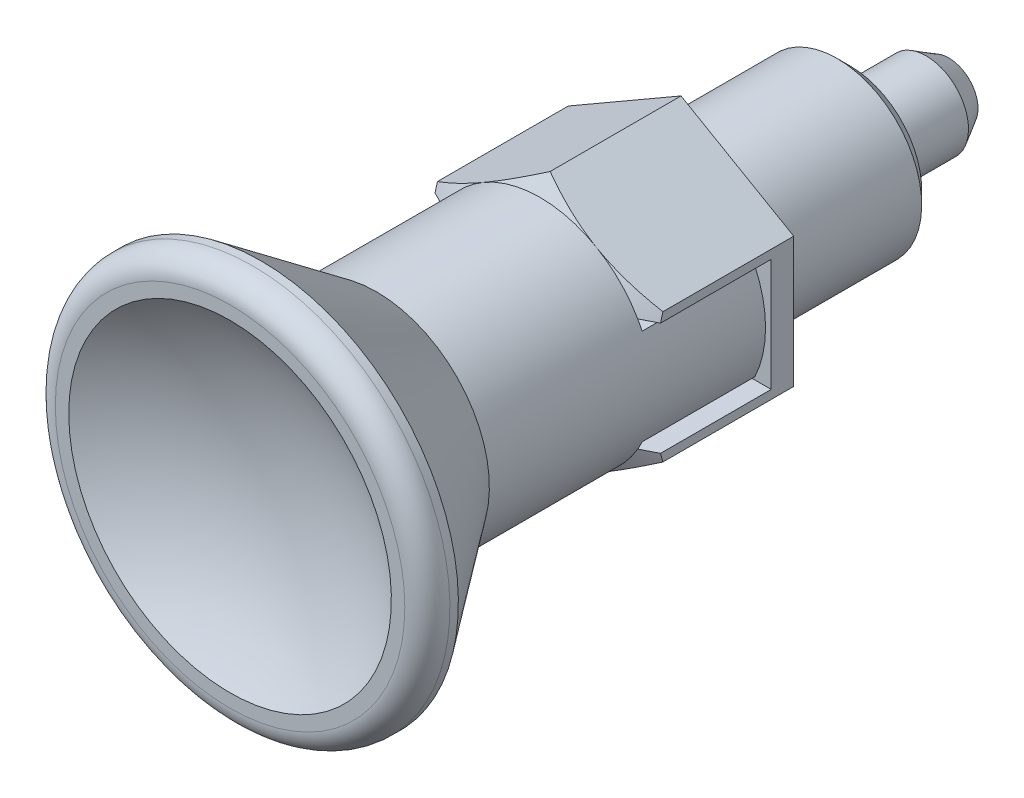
ISO-10303-21;
HEADER;
FILE_DESCRIPTION(('STEP AP214'),'2;1');
FILE_NAME('part.step','',(''),(''),'','','');
FILE_SCHEMA(('AUTOMOTIVE_DESIGN { 1 0 10303 214 1 1 1 1 }'));
ENDSEC;
DATA;
#1=APPLICATION_CONTEXT('core data for automotive mechanical design processes');
#2=APPLICATION_PROTOCOL_DEFINITION('international standard','automotive_design',2000,#1);
#3=PRODUCT_CONTEXT('',#1,'mechanical');
#4=PRODUCT('Part','Part','',(#3));
#5=PRODUCT_RELATED_PRODUCT_CATEGORY('part','',(#4));
#6=PRODUCT_DEFINITION_FORMATION('','',#4);
#7=PRODUCT_DEFINITION_CONTEXT('part definition',#1,'design');
#8=PRODUCT_DEFINITION('design','',#6,#7);
#9=PRODUCT_DEFINITION_SHAPE('','',#8);
#10=(LENGTH_UNIT() NAMED_UNIT(*) SI_UNIT(.MILLI.,.METRE.));
#11=(NAMED_UNIT(*) PLANE_ANGLE_UNIT() SI_UNIT($,.RADIAN.));
#12=(NAMED_UNIT(*) SI_UNIT($,.STERADIAN.) SOLID_ANGLE_UNIT());
#13=UNCERTAINTY_MEASURE_WITH_UNIT(LENGTH_MEASURE(1.E-05),#10,'distance_accuracy_value','');
#14=(GEOMETRIC_REPRESENTATION_CONTEXT(3) GLOBAL_UNCERTAINTY_ASSIGNED_CONTEXT((#13)) GLOBAL_UNIT_ASSIGNED_CONTEXT((#10,
#11,#12)) REPRESENTATION_CONTEXT('',''));
#15=CARTESIAN_POINT('',(0.,0.,0.));
#16=DIRECTION('',(0.,0.,1.));
#17=DIRECTION('',(1.,0.,0.));
#18=AXIS2_PLACEMENT_3D('',#15,#16,#17);
#19=CARTESIAN_POINT('',(4.,-2.3094010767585,-1.));
#20=DIRECTION('',(1.,0.,0.));
#21=DIRECTION('',(0.,1.,0.));
#22=AXIS2_PLACEMENT_3D('',#19,#20,#21);
#23=PLANE('',#22);
#24=DIRECTION('',(0.,-1.,0.));
#25=VECTOR('',#24,1.);
#26=CARTESIAN_POINT('',(4.,-2.3094010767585,0.8));
#27=LINE('',#26,#25);
#28=CARTESIAN_POINT('',(4.,2.,0.8));
#29=VERTEX_POINT('',#28);
#30=CARTESIAN_POINT('',(4.,-2.,0.8));
#31=VERTEX_POINT('',#30);
#32=EDGE_CURVE('E581',#29,#31,#27,.T.);
#33=ORIENTED_EDGE('',*,*,#32,.T.);
#34=DIRECTION('',(0.,0.,1.));
#35=VECTOR('',#34,1.);
#36=CARTESIAN_POINT('',(4.,-2.,-1.));
#37=LINE('',#36,#35);
#38=CARTESIAN_POINT('',(4.00000000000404,-2.,4.72741217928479));
#39=VERTEX_POINT('',#38);
#40=EDGE_CURVE('E383',#31,#39,#37,.T.);
#41=ORIENTED_EDGE('',*,*,#40,.T.);
#42=CARTESIAN_POINT('',(4.,6.23617092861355,3.03194747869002));
#43=CARTESIAN_POINT('',(4.,6.06119073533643,3.11696006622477));
#44=CARTESIAN_POINT('',(4.,5.88581238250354,3.20116698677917));
#45=CARTESIAN_POINT('',(4.,5.53404775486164,3.36751704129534));
#46=CARTESIAN_POINT('',(4.,5.35766132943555,3.44965985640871));
#47=CARTESIAN_POINT('',(4.,5.00277577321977,3.61183552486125));
#48=CARTESIAN_POINT('',(4.,4.82427038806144,3.69185473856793));
#49=CARTESIAN_POINT('',(4.,4.46585134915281,3.84866226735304));
#50=CARTESIAN_POINT('',(4.,4.2859377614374,3.92545073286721));
#51=CARTESIAN_POINT('',(4.,3.91847481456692,4.07740180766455));
#52=CARTESIAN_POINT('',(4.,3.73086878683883,4.15242811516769));
#53=CARTESIAN_POINT('',(4.,3.35347395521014,4.29688156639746));
#54=CARTESIAN_POINT('',(4.,3.16368491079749,4.36630808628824));
#55=CARTESIAN_POINT('',(4.,2.78196693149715,4.49776338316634));
#56=CARTESIAN_POINT('',(4.,2.59004310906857,4.55980685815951));
#57=CARTESIAN_POINT('',(4.,2.20344232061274,4.67452681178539));
#58=CARTESIAN_POINT('',(4.,2.00876623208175,4.72720620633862));
#59=CARTESIAN_POINT('',(4.,1.61764283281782,4.82040801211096));
#60=CARTESIAN_POINT('',(4.,1.42121188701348,4.86099784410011));
#61=CARTESIAN_POINT('',(4.,1.02587277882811,4.92775174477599));
#62=CARTESIAN_POINT('',(4.,0.826964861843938,4.95391723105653));
#63=CARTESIAN_POINT('',(4.,0.430276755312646,4.98939391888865));
#64=CARTESIAN_POINT('',(4.,0.232516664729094,4.99892431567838));
#65=CARTESIAN_POINT('',(4.,-0.163106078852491,5.00090183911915));
#66=CARTESIAN_POINT('',(4.,-0.360968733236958,4.99334872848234));
#67=CARTESIAN_POINT('',(4.,-0.695916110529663,4.96664010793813));
#68=CARTESIAN_POINT('',(4.,-0.833355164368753,4.95166491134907));
#69=CARTESIAN_POINT('',(4.,-1.10724257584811,4.91438647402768));
#70=CARTESIAN_POINT('',(4.,-1.2436908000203,4.89208226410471));
#71=CARTESIAN_POINT('',(4.,-1.65135949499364,4.81534673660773));
#72=CARTESIAN_POINT('',(4.,-1.92075496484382,4.75110599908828));
#73=CARTESIAN_POINT('',(4.,-2.32360769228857,4.63951703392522));
#74=CARTESIAN_POINT('',(4.,-2.4591482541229,4.59925972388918));
#75=CARTESIAN_POINT('',(4.,-2.72891318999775,4.51451498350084));
#76=CARTESIAN_POINT('',(4.,-2.8631375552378,4.47002752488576));
#77=CARTESIAN_POINT('',(4.,-3.13031156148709,4.37754043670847));
#78=CARTESIAN_POINT('',(4.,-3.26326159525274,4.32954193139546));
#79=CARTESIAN_POINT('',(4.,-3.52805698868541,4.23060228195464));
#80=CARTESIAN_POINT('',(4.,-3.65990236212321,4.17966117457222));
#81=CARTESIAN_POINT('',(4.,-3.97416540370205,4.05484839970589));
#82=CARTESIAN_POINT('',(4.,-4.15612416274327,3.97982329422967));
#83=CARTESIAN_POINT('',(4.,-4.51846176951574,3.82603918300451));
#84=CARTESIAN_POINT('',(4.,-4.69884051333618,3.74727993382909));
#85=CARTESIAN_POINT('',(4.,-5.05831353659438,3.58678806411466));
#86=CARTESIAN_POINT('',(4.,-5.23740752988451,3.50505480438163));
#87=CARTESIAN_POINT('',(4.,-5.59449459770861,3.33921405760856));
#88=CARTESIAN_POINT('',(4.,-5.7724876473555,3.25510651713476));
#89=CARTESIAN_POINT('',(4.,-6.30549271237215,2.99973471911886));
#90=CARTESIAN_POINT('',(4.,-6.65912985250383,2.82560283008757));
#91=CARTESIAN_POINT('',(4.,-7.36376590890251,2.47222645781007));
#92=CARTESIAN_POINT('',(4.,-7.71476515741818,2.29298263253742));
#93=CARTESIAN_POINT('',(4.,-8.38488414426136,1.94637634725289));
#94=CARTESIAN_POINT('',(4.,-8.70415832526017,1.77931192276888));
#95=CARTESIAN_POINT('',(4.,-9.34151791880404,1.44290549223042));
#96=CARTESIAN_POINT('',(4.,-9.65960328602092,1.27356340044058));
#97=CARTESIAN_POINT('',(4.,-10.2940205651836,0.93358958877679));
#98=CARTESIAN_POINT('',(4.,-10.6103548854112,0.762962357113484));
#99=CARTESIAN_POINT('',(4.,-11.2422650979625,0.420351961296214));
#100=CARTESIAN_POINT('',(4.,-11.5578410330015,0.248368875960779));
#101=CARTESIAN_POINT('',(4.,-11.8731389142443,0.0758812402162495));
#102=B_SPLINE_CURVE_WITH_KNOTS('',3,(#42,#43,#44,#45,#46,#47,#48,#49,#50,#51,#52,#53,#54,#55,
#56,#57,#58,#59,#60,#61,#62,#63,#64,#65,#66,#67,#68,#69,#70,#71,#72,#73,#74,#75,#76,#77,#78,#79,
#80,#81,#82,#83,#84,#85,#86,#87,#88,#89,#90,#91,#92,#93,#94,#95,#96,#97,#98,#99,#100,#101),
.UNSPECIFIED.,.F.,.F.,(4,2,2,2,2,2,2,2,2,2,2,2,2,2,2,2,2,2,2,2,2,2,2,2,2,2,2,2,2,4),(0.,
0.583622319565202,1.16733424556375,1.75416907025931,2.34097653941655,2.94706311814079,
3.55321712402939,4.15814347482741,4.76288112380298,5.36418027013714,5.96542031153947,
6.55867644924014,7.15194082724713,7.56649775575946,7.98110952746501,8.8107799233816,
9.23492134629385,9.65906560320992,10.0830746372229,10.5070783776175,11.0974789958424,
11.6879181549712,12.2784849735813,12.8690650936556,14.0515449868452,15.2338733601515,
16.3148878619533,17.3959431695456,18.4741925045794,19.5523796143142),.UNSPECIFIED.);
#103=CARTESIAN_POINT('',(4.,-2.3094010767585,4.64273441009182));
#104=VERTEX_POINT('',#103);
#105=EDGE_CURVE('E590',#104,#39,#102,.F.);
#106=ORIENTED_EDGE('',*,*,#105,.F.);
#107=DIRECTION('',(0.,0.,1.));
#108=VECTOR('',#107,1.);
#109=CARTESIAN_POINT('',(4.,-2.3094010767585,-1.));
#110=LINE('',#109,#108);
#111=CARTESIAN_POINT('',(4.,-2.3094010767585,0.));
#112=VERTEX_POINT('',#111);
#113=EDGE_CURVE('E410',#112,#104,#110,.T.);
#114=ORIENTED_EDGE('',*,*,#113,.F.);
#115=DIRECTION('',(0.,-1.,0.));
#116=VECTOR('',#115,1.);
#117=CARTESIAN_POINT('',(4.,0.,0.));
#118=LINE('',#117,#116);
#119=CARTESIAN_POINT('',(4.,2.3094010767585,0.));
#120=VERTEX_POINT('',#119);
#121=EDGE_CURVE('E434',#120,#112,#118,.T.);
#122=ORIENTED_EDGE('',*,*,#121,.F.);
#123=DIRECTION('',(0.,0.,1.));
#124=VECTOR('',#123,1.);
#125=CARTESIAN_POINT('',(4.,2.3094010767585,-1.));
#126=LINE('',#125,#124);
#127=CARTESIAN_POINT('',(4.,2.3094010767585,4.64273441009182));
#128=VERTEX_POINT('',#127);
#129=EDGE_CURVE('E414',#120,#128,#126,.T.);
#130=ORIENTED_EDGE('',*,*,#129,.T.);
#131=CARTESIAN_POINT('',(3.99999999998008,2.,4.72741217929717));
#132=VERTEX_POINT('',#131);
#133=EDGE_CURVE('E555',#132,#128,#102,.F.);
#134=ORIENTED_EDGE('',*,*,#133,.F.);
#135=DIRECTION('',(0.,0.,-1.));
#136=VECTOR('',#135,1.);
#137=CARTESIAN_POINT('',(4.,2.,-1.));
#138=LINE('',#137,#136);
#139=EDGE_CURVE('E352',#132,#29,#138,.T.);
#140=ORIENTED_EDGE('',*,*,#139,.T.);
#141=EDGE_LOOP('',(#33,#41,#106,#114,#122,#130,#134,#140));
#142=FACE_BOUND('',#141,.T.);
#143=ADVANCED_FACE('F16',(#142),#23,.T.);
#144=CARTESIAN_POINT('',(0.,0.,3.8452994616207));
#145=DIRECTION('',(0.,0.,-1.));
#146=DIRECTION('',(0.,1.,0.));
#147=AXIS2_PLACEMENT_3D('',#144,#145,#146);
#148=CONICAL_SURFACE('',#147,6.,1.04719755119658);
#149=ORIENTED_EDGE('',*,*,#105,.T.);
#150=CARTESIAN_POINT('',(6.54485852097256,-2.,3.35823360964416));
#151=CARTESIAN_POINT('',(6.41788262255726,-2.,3.42834117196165));
#152=CARTESIAN_POINT('',(6.29083452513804,-2.,3.49831797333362));
#153=CARTESIAN_POINT('',(6.03656362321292,-2.,3.637954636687));
#154=CARTESIAN_POINT('',(5.90934081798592,-2.,3.70761449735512));
#155=CARTESIAN_POINT('',(5.52745619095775,-2.,3.91598570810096));
#156=CARTESIAN_POINT('',(5.27248870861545,-2.,4.05413817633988));
#157=CARTESIAN_POINT('',(4.76221685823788,-2.,4.32780269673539));
#158=CARTESIAN_POINT('',(4.5069163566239,-2.,4.46332193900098));
#159=CARTESIAN_POINT('',(3.99444443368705,-2.,4.7310559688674));
#160=CARTESIAN_POINT('',(3.73727227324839,-2.,4.86326934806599));
#161=CARTESIAN_POINT('',(3.26498226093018,-2.,5.09967278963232));
#162=CARTESIAN_POINT('',(3.05031018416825,-2.,5.20474469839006));
#163=CARTESIAN_POINT('',(2.72618693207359,-2.,5.35762602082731));
#164=CARTESIAN_POINT('',(2.61784296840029,-2.,5.40777701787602));
#165=CARTESIAN_POINT('',(2.40023044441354,-2.,5.50602577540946));
#166=CARTESIAN_POINT('',(2.29096192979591,-2.,5.55412363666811));
#167=CARTESIAN_POINT('',(2.07084539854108,-2.,5.64779089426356));
#168=CARTESIAN_POINT('',(1.95999294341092,-2.,5.6933499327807));
#169=CARTESIAN_POINT('',(1.73688431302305,-2.,5.78077940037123));
#170=CARTESIAN_POINT('',(1.62462872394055,-2.,5.8226513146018));
#171=CARTESIAN_POINT('',(1.39798153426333,-2.,5.90154823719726));
#172=CARTESIAN_POINT('',(1.28358416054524,-2.,5.93855698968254));
#173=CARTESIAN_POINT('',(1.11041686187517,-2.,5.98897864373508));
#174=CARTESIAN_POINT('',(1.052391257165,-2.,6.00494670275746));
#175=CARTESIAN_POINT('',(0.935813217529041,-2.,6.03490495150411));
#176=CARTESIAN_POINT('',(0.877260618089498,-2.,6.04889449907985));
#177=CARTESIAN_POINT('',(0.818448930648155,-2.,6.06175547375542));
#178=B_SPLINE_CURVE_WITH_KNOTS('',3,(#150,#151,#152,#153,#154,#155,#156,#157,#158,#159,#160,
#161,#162,#163,#164,#165,#166,#167,#168,#169,#170,#171,#172,#173,#174,#175,#176,#177),
.UNSPECIFIED.,.F.,.F.,(4,2,2,2,2,2,2,2,2,2,2,2,2,4),(0.,0.435133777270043,0.870269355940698,
1.74023383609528,2.60733687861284,3.47480324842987,4.19175065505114,4.5498994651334,
4.90803067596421,5.26752960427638,5.62688305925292,5.98740870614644,6.16792522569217,
6.34850020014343),.UNSPECIFIED.);
#179=CARTESIAN_POINT('',(3.46410161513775,-2.,5.));
#180=VERTEX_POINT('',#179);
#181=EDGE_CURVE('E375',#39,#180,#178,.T.);
#182=ORIENTED_EDGE('',*,*,#181,.T.);
#183=CARTESIAN_POINT('',(0.,0.,5.));
#184=DIRECTION('',(0.,0.,-1.));
#185=DIRECTION('',(0.,1.,0.));
#186=AXIS2_PLACEMENT_3D('',#183,#184,#185);
#187=CIRCLE('',#186,4.);
#188=CARTESIAN_POINT('',(2.,-3.46410161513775,5.));
#189=VERTEX_POINT('',#188);
#190=EDGE_CURVE('E450',#180,#189,#187,.T.);
#191=ORIENTED_EDGE('',*,*,#190,.T.);
#192=CARTESIAN_POINT('',(-0.0002,-4.61891762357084,4.64266774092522));
#193=CARTESIAN_POINT('',(0.175579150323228,-4.5174314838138,4.70128212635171));
#194=CARTESIAN_POINT('',(0.352875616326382,-4.41506932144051,4.75458967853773));
#195=CARTESIAN_POINT('',(0.710538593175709,-4.20857250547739,4.84763832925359));
#196=CARTESIAN_POINT('',(0.890911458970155,-4.10443418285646,4.8873465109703));
#197=CARTESIAN_POINT('',(1.2494218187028,-3.89744813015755,4.94915778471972));
#198=CARTESIAN_POINT('',(1.42750415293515,-3.79463224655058,4.97167226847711));
#199=CARTESIAN_POINT('',(1.78450671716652,-3.58851671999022,4.99854937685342));
#200=CARTESIAN_POINT('',(1.96342564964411,-3.48521782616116,5.00293425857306));
#201=CARTESIAN_POINT('',(2.29774284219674,-3.29219970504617,4.99380992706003));
#202=CARTESIAN_POINT('',(2.45319115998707,-3.20245157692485,4.98254104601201));
#203=CARTESIAN_POINT('',(2.76307505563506,-3.02354002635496,4.94682600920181));
#204=CARTESIAN_POINT('',(2.91750956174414,-2.93437722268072,4.92236765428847));
#205=CARTESIAN_POINT('',(3.22803232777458,-2.75509682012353,4.86122393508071));
#206=CARTESIAN_POINT('',(3.38408128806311,-2.66500191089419,4.82427939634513));
#207=CARTESIAN_POINT('',(3.69385183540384,-2.486155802,4.74042992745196));
#208=CARTESIAN_POINT('',(3.84757739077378,-2.39740231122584,4.69354469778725));
#209=CARTESIAN_POINT('',(4.0002,-2.30928560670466,4.64266774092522));
#210=B_SPLINE_CURVE_WITH_KNOTS('',3,(#192,#193,#194,#195,#196,#197,#198,#199,#200,#201,#202,
#203,#204,#205,#206,#207,#208,#209),.UNSPECIFIED.,.F.,.F.,(4,2,2,2,2,2,2,2,4),(0.,
0.634047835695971,1.26961969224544,1.88946157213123,2.50854226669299,3.04757825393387,
3.58711366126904,4.13861653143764,4.68903648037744),.UNSPECIFIED.);
#211=EDGE_CURVE('E541',#189,#104,#210,.T.);
#212=ORIENTED_EDGE('',*,*,#211,.T.);
#213=EDGE_LOOP('',(#149,#182,#191,#212));
#214=FACE_BOUND('',#213,.T.);
#215=ADVANCED_FACE('F354',(#214),#148,.T.);
#216=CARTESIAN_POINT('',(2.,3.46410161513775,5.));
#217=VERTEX_POINT('',#216);
#218=CARTESIAN_POINT('',(3.46410161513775,2.,5.));
#219=VERTEX_POINT('',#218);
#220=EDGE_CURVE('E445',#217,#219,#187,.T.);
#221=ORIENTED_EDGE('',*,*,#220,.T.);
#222=CARTESIAN_POINT('',(0.84905697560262,2.,6.05495594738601));
#223=CARTESIAN_POINT('',(0.945372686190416,2.,6.03319896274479));
#224=CARTESIAN_POINT('',(1.04096598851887,2.,6.00852205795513));
#225=CARTESIAN_POINT('',(1.23071670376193,2.,5.95443482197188));
#226=CARTESIAN_POINT('',(1.32487537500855,2.,5.9250289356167));
#227=CARTESIAN_POINT('',(1.51172044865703,2.,5.86262058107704));
#228=CARTESIAN_POINT('',(1.60440984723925,2.,5.82962693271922));
#229=CARTESIAN_POINT('',(1.78874364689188,2.,5.76078232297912));
#230=CARTESIAN_POINT('',(1.88038776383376,2.,5.72493060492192));
#231=CARTESIAN_POINT('',(2.06243027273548,2.,5.65114563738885));
#232=CARTESIAN_POINT('',(2.15283203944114,2.,5.61322066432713));
#233=CARTESIAN_POINT('',(2.33288747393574,2.,5.53563050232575));
#234=CARTESIAN_POINT('',(2.42254110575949,2.,5.49596523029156));
#235=CARTESIAN_POINT('',(2.69065529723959,2.,5.37487787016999));
#236=CARTESIAN_POINT('',(2.86818647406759,2.,5.2913985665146));
#237=CARTESIAN_POINT('',(3.11829277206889,2.,5.17069732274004));
#238=CARTESIAN_POINT('',(3.19158849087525,2.,5.13494504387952));
#239=CARTESIAN_POINT('',(3.33794444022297,2.,5.06289189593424));
#240=CARTESIAN_POINT('',(3.41100457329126,2.,5.0265908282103));
#241=CARTESIAN_POINT('',(3.74540440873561,2.,4.85916451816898));
#242=CARTESIAN_POINT('',(4.0054227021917,2.,4.72540238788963));
#243=CARTESIAN_POINT('',(4.52368706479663,2.,4.45447482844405));
#244=CARTESIAN_POINT('',(4.78193301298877,2.,4.31730916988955));
#245=CARTESIAN_POINT('',(5.29664045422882,2.,4.04109781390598));
#246=CARTESIAN_POINT('',(5.55310470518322,2.,3.90205725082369));
#247=CARTESIAN_POINT('',(5.93716911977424,2.,3.69239189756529));
#248=CARTESIAN_POINT('',(6.06507486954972,2.,3.62232511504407));
#249=CARTESIAN_POINT('',(6.3207117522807,2.,3.48187546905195));
#250=CARTESIAN_POINT('',(6.44844288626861,2.,3.41149260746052));
#251=CARTESIAN_POINT('',(6.57610198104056,2.,3.34097917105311));
#252=B_SPLINE_CURVE_WITH_KNOTS('',3,(#222,#223,#224,#225,#226,#227,#228,#229,#230,#231,#232,
#233,#234,#235,#236,#237,#238,#239,#240,#241,#242,#243,#244,#245,#246,#247,#248,#249,#250,#251),
.UNSPECIFIED.,.F.,.F.,(4,2,2,2,2,2,2,2,2,2,2,2,2,2,4),(0.,0.296093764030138,0.591910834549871,
0.887016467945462,1.18220049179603,1.47628178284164,1.77037713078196,2.35883626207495,
2.60348783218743,2.84823018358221,3.72539868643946,4.60262646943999,5.47780710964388,
5.91532614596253,6.35284258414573),.UNSPECIFIED.);
#253=EDGE_CURVE('E343',#219,#132,#252,.T.);
#254=ORIENTED_EDGE('',*,*,#253,.T.);
#255=ORIENTED_EDGE('',*,*,#133,.T.);
#256=CARTESIAN_POINT('',(4.0002,2.30928560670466,4.64266774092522));
#257=CARTESIAN_POINT('',(3.82442084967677,2.4107717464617,4.70128212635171));
#258=CARTESIAN_POINT('',(3.64712438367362,2.51313390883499,4.75458967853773));
#259=CARTESIAN_POINT('',(3.28946140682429,2.71963072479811,4.84763832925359));
#260=CARTESIAN_POINT('',(3.10908854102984,2.82376904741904,4.88734651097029));
#261=CARTESIAN_POINT('',(2.7505781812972,3.03075510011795,4.94915778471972));
#262=CARTESIAN_POINT('',(2.57249584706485,3.13357098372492,4.97167226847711));
#263=CARTESIAN_POINT('',(2.21549328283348,3.33968651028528,4.99854937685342));
#264=CARTESIAN_POINT('',(2.03657435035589,3.44298540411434,5.00293425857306));
#265=CARTESIAN_POINT('',(1.70225715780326,3.63600352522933,4.99380992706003));
#266=CARTESIAN_POINT('',(1.54680884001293,3.72575165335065,4.98254104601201));
#267=CARTESIAN_POINT('',(1.23692494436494,3.90466320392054,4.94682600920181));
#268=CARTESIAN_POINT('',(1.08249043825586,3.99382600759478,4.92236765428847));
#269=CARTESIAN_POINT('',(0.771967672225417,4.17310641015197,4.86122393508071));
#270=CARTESIAN_POINT('',(0.615918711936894,4.26320131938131,4.82427939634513));
#271=CARTESIAN_POINT('',(0.306148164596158,4.4420474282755,4.74042992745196));
#272=CARTESIAN_POINT('',(0.152422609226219,4.53080091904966,4.69354469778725));
#273=CARTESIAN_POINT('',(-0.000200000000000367,4.61891762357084,4.64266774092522));
#274=B_SPLINE_CURVE_WITH_KNOTS('',3,(#256,#257,#258,#259,#260,#261,#262,#263,#264,#265,#266,
#267,#268,#269,#270,#271,#272,#273),.UNSPECIFIED.,.F.,.F.,(4,2,2,2,2,2,2,2,4),(0.,
0.634047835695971,1.26961969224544,1.88946157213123,2.50854226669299,3.04757825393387,
3.58711366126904,4.13861653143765,4.68903648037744),.UNSPECIFIED.);
#275=EDGE_CURVE('E554',#128,#217,#274,.T.);
#276=ORIENTED_EDGE('',*,*,#275,.T.);
#277=EDGE_LOOP('',(#221,#254,#255,#276));
#278=FACE_BOUND('',#277,.T.);
#279=ADVANCED_FACE('F577',(#278),#148,.T.);
#280=CARTESIAN_POINT('',(0.,0.,-9.5));
#281=DIRECTION('',(0.,0.,-1.));
#282=DIRECTION('',(0.,1.,0.));
#283=AXIS2_PLACEMENT_3D('',#280,#281,#282);
#284=CYLINDRICAL_SURFACE('',#283,4.);
#285=CARTESIAN_POINT('',(0.,0.,10.8));
#286=DIRECTION('',(0.,0.,-1.));
#287=DIRECTION('',(0.,1.,0.));
#288=AXIS2_PLACEMENT_3D('',#285,#286,#287);
#289=CIRCLE('',#288,4.);
#290=CARTESIAN_POINT('',(0.,4.,10.8));
#291=VERTEX_POINT('',#290);
#292=EDGE_CURVE('E476',#291,#291,#289,.T.);
#293=ORIENTED_EDGE('',*,*,#292,.T.);
#294=EDGE_LOOP('',(#293));
#295=FACE_BOUND('',#294,.T.);
#296=DIRECTION('',(0.,0.,1.));
#297=VECTOR('',#296,1.);
#298=CARTESIAN_POINT('',(-3.6207733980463,1.7,0.8));
#299=LINE('',#298,#297);
#300=CARTESIAN_POINT('',(-3.6207733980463,1.7,1.));
#301=VERTEX_POINT('',#300);
#302=CARTESIAN_POINT('',(-3.6207733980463,1.7,5.));
#303=VERTEX_POINT('',#302);
#304=EDGE_CURVE('E387',#301,#303,#299,.T.);
#305=ORIENTED_EDGE('',*,*,#304,.F.);
#306=CARTESIAN_POINT('',(0.,0.,1.));
#307=DIRECTION('',(0.,0.,1.));
#308=DIRECTION('',(0.,-1.,0.));
#309=AXIS2_PLACEMENT_3D('',#306,#307,#308);
#310=CIRCLE('',#309,4.);
#311=CARTESIAN_POINT('',(-3.6207733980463,-1.7,1.));
#312=VERTEX_POINT('',#311);
#313=EDGE_CURVE('E206',#301,#312,#310,.T.);
#314=ORIENTED_EDGE('',*,*,#313,.T.);
#315=DIRECTION('',(0.,0.,1.));
#316=VECTOR('',#315,1.);
#317=CARTESIAN_POINT('',(-3.6207733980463,-1.7,0.8));
#318=LINE('',#317,#316);
#319=CARTESIAN_POINT('',(-3.6207733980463,-1.7,5.));
#320=VERTEX_POINT('',#319);
#321=EDGE_CURVE('E390',#312,#320,#318,.T.);
#322=ORIENTED_EDGE('',*,*,#321,.T.);
#323=CARTESIAN_POINT('',(0.,0.,5.));
#324=DIRECTION('',(0.,0.,1.));
#325=DIRECTION('',(0.,-1.,0.));
#326=AXIS2_PLACEMENT_3D('',#323,#324,#325);
#327=CIRCLE('',#326,4.);
#328=CARTESIAN_POINT('',(-3.46410161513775,-2.,5.));
#329=VERTEX_POINT('',#328);
#330=EDGE_CURVE('E271',#329,#320,#327,.F.);
#331=ORIENTED_EDGE('',*,*,#330,.F.);
#332=CARTESIAN_POINT('',(-2.,-3.46410161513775,5.));
#333=VERTEX_POINT('',#332);
#334=EDGE_CURVE('E617',#333,#329,#187,.T.);
#335=ORIENTED_EDGE('',*,*,#334,.F.);
#336=EDGE_CURVE('E452',#189,#333,#187,.T.);
#337=ORIENTED_EDGE('',*,*,#336,.F.);
#338=ORIENTED_EDGE('',*,*,#190,.F.);
#339=CARTESIAN_POINT('',(3.6207733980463,-1.7,5.));
#340=VERTEX_POINT('',#339);
#341=EDGE_CURVE('E446',#340,#180,#187,.T.);
#342=ORIENTED_EDGE('',*,*,#341,.F.);
#343=DIRECTION('',(0.,0.,1.));
#344=VECTOR('',#343,1.);
#345=CARTESIAN_POINT('',(3.6207733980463,-1.7,0.8));
#346=LINE('',#345,#344);
#347=CARTESIAN_POINT('',(3.6207733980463,-1.7,1.));
#348=VERTEX_POINT('',#347);
#349=EDGE_CURVE('E394',#348,#340,#346,.T.);
#350=ORIENTED_EDGE('',*,*,#349,.F.);
#351=CARTESIAN_POINT('',(0.,0.,1.));
#352=DIRECTION('',(0.,0.,-1.));
#353=DIRECTION('',(0.,1.,0.));
#354=AXIS2_PLACEMENT_3D('',#351,#352,#353);
#355=CIRCLE('',#354,4.);
#356=CARTESIAN_POINT('',(3.6207733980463,1.7,1.));
#357=VERTEX_POINT('',#356);
#358=EDGE_CURVE('E337',#357,#348,#355,.T.);
#359=ORIENTED_EDGE('',*,*,#358,.F.);
#360=DIRECTION('',(0.,0.,1.));
#361=VECTOR('',#360,1.);
#362=CARTESIAN_POINT('',(3.6207733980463,1.7,0.8));
#363=LINE('',#362,#361);
#364=CARTESIAN_POINT('',(3.6207733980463,1.7,5.));
#365=VERTEX_POINT('',#364);
#366=EDGE_CURVE('E397',#357,#365,#363,.T.);
#367=ORIENTED_EDGE('',*,*,#366,.T.);
#368=CARTESIAN_POINT('',(0.,0.,5.));
#369=DIRECTION('',(0.,0.,-1.));
#370=DIRECTION('',(0.,1.,0.));
#371=AXIS2_PLACEMENT_3D('',#368,#369,#370);
#372=CIRCLE('',#371,4.);
#373=EDGE_CURVE('E340',#219,#365,#372,.T.);
#374=ORIENTED_EDGE('',*,*,#373,.F.);
#375=ORIENTED_EDGE('',*,*,#220,.F.);
#376=CARTESIAN_POINT('',(-2.,3.46410161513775,5.));
#377=VERTEX_POINT('',#376);
#378=EDGE_CURVE('E614',#377,#217,#187,.T.);
#379=ORIENTED_EDGE('',*,*,#378,.F.);
#380=CARTESIAN_POINT('',(-3.46410161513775,2.,5.));
#381=VERTEX_POINT('',#380);
#382=EDGE_CURVE('E451',#381,#377,#187,.T.);
#383=ORIENTED_EDGE('',*,*,#382,.F.);
#384=EDGE_CURVE('E615',#303,#381,#187,.T.);
#385=ORIENTED_EDGE('',*,*,#384,.F.);
#386=EDGE_LOOP('',(#305,#314,#322,#331,#335,#337,#338,#342,#350,#359,#367,#374,#375,#379,#383,#385));
#387=FACE_BOUND('',#386,.T.);
#388=ADVANCED_FACE('F606',(#295,#387),#284,.T.);
#389=CARTESIAN_POINT('',(3.,0.,0.));
#390=DIRECTION('',(0.,0.,-1.));
#391=DIRECTION('',(0.,1.,0.));
#392=AXIS2_PLACEMENT_3D('',#389,#390,#391);
#393=PLANE('',#392);
#394=ORIENTED_EDGE('',*,*,#121,.T.);
#395=DIRECTION('',(-0.866025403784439,-0.5,0.));
#396=VECTOR('',#395,1.);
#397=CARTESIAN_POINT('',(4.25,-2.1650635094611,0.));
#398=LINE('',#397,#396);
#399=CARTESIAN_POINT('',(0.,-4.618802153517,0.));
#400=VERTEX_POINT('',#399);
#401=EDGE_CURVE('E430',#112,#400,#398,.T.);
#402=ORIENTED_EDGE('',*,*,#401,.T.);
#403=DIRECTION('',(-0.866025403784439,0.5,0.));
#404=VECTOR('',#403,1.);
#405=CARTESIAN_POINT('',(0.250000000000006,-4.76313972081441,0.));
#406=LINE('',#405,#404);
#407=CARTESIAN_POINT('',(-4.,-2.3094010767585,0.));
#408=VERTEX_POINT('',#407);
#409=EDGE_CURVE('E426',#400,#408,#406,.T.);
#410=ORIENTED_EDGE('',*,*,#409,.T.);
#411=DIRECTION('',(0.,1.,0.));
#412=VECTOR('',#411,1.);
#413=CARTESIAN_POINT('',(-4.,0.,0.));
#414=LINE('',#413,#412);
#415=CARTESIAN_POINT('',(-4.,2.3094010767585,0.));
#416=VERTEX_POINT('',#415);
#417=EDGE_CURVE('E419',#408,#416,#414,.T.);
#418=ORIENTED_EDGE('',*,*,#417,.T.);
#419=DIRECTION('',(0.866025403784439,0.5,0.));
#420=VECTOR('',#419,1.);
#421=CARTESIAN_POINT('',(0.250000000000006,4.76313972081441,0.));
#422=LINE('',#421,#420);
#423=CARTESIAN_POINT('',(0.,4.618802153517,0.));
#424=VERTEX_POINT('',#423);
#425=EDGE_CURVE('E441',#416,#424,#422,.T.);
#426=ORIENTED_EDGE('',*,*,#425,.T.);
#427=DIRECTION('',(0.866025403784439,-0.5,0.));
#428=VECTOR('',#427,1.);
#429=CARTESIAN_POINT('',(4.25,2.1650635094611,0.));
#430=LINE('',#429,#428);
#431=EDGE_CURVE('E437',#424,#120,#430,.T.);
#432=ORIENTED_EDGE('',*,*,#431,.T.);
#433=EDGE_LOOP('',(#394,#402,#410,#418,#426,#432));
#434=FACE_BOUND('',#433,.T.);
#435=CARTESIAN_POINT('',(0.,0.,0.));
#436=DIRECTION('',(0.,0.,-1.));
#437=DIRECTION('',(0.,1.,0.));
#438=AXIS2_PLACEMENT_3D('',#435,#436,#437);
#439=CIRCLE('',#438,3.);
#440=CARTESIAN_POINT('',(0.,3.,0.));
#441=VERTEX_POINT('',#440);
#442=EDGE_CURVE('E449',#441,#441,#439,.T.);
#443=ORIENTED_EDGE('',*,*,#442,.F.);
#444=EDGE_LOOP('',(#443));
#445=FACE_BOUND('',#444,.T.);
#446=ADVANCED_FACE('F658',(#434,#445),#393,.T.);
#447=CARTESIAN_POINT('',(1.5,0.,-6.));
#448=DIRECTION('',(0.,0.,-1.));
#449=DIRECTION('',(0.,1.,0.));
#450=AXIS2_PLACEMENT_3D('',#447,#448,#449);
#451=PLANE('',#450);
#452=CARTESIAN_POINT('',(0.,0.,-6.));
#453=DIRECTION('',(0.,0.,-1.));
#454=DIRECTION('',(0.,1.,0.));
#455=AXIS2_PLACEMENT_3D('',#452,#453,#454);
#456=CIRCLE('',#455,2.54);
#457=CARTESIAN_POINT('',(0.,2.54,-6.));
#458=VERTEX_POINT('',#457);
#459=EDGE_CURVE('E460',#458,#458,#456,.T.);
#460=ORIENTED_EDGE('',*,*,#459,.T.);
#461=EDGE_LOOP('',(#460));
#462=FACE_BOUND('',#461,.T.);
#463=CARTESIAN_POINT('',(0.,0.,-6.));
#464=DIRECTION('',(0.,0.,-1.));
#465=DIRECTION('',(0.,1.,0.));
#466=AXIS2_PLACEMENT_3D('',#463,#464,#465);
#467=CIRCLE('',#466,1.5);
#468=CARTESIAN_POINT('',(0.,1.5,-6.));
#469=VERTEX_POINT('',#468);
#470=EDGE_CURVE('E464',#469,#469,#467,.T.);
#471=ORIENTED_EDGE('',*,*,#470,.F.);
#472=EDGE_LOOP('',(#471));
#473=FACE_BOUND('',#472,.T.);
#474=ADVANCED_FACE('F948',(#462,#473),#451,.T.);
#475=CARTESIAN_POINT('',(0.,0.,-6.));
#476=DIRECTION('',(0.,0.,1.));
#477=DIRECTION('',(0.,-1.,0.));
#478=AXIS2_PLACEMENT_3D('',#475,#476,#477);
#479=CONICAL_SURFACE('',#478,2.54,0.785398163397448);
#480=CARTESIAN_POINT('',(0.,0.,-5.54));
#481=DIRECTION('',(0.,0.,-1.));
#482=DIRECTION('',(0.,1.,0.));
#483=AXIS2_PLACEMENT_3D('',#480,#481,#482);
#484=CIRCLE('',#483,3.);
#485=CARTESIAN_POINT('',(0.,3.,-5.54));
#486=VERTEX_POINT('',#485);
#487=EDGE_CURVE('E456',#486,#486,#484,.T.);
#488=ORIENTED_EDGE('',*,*,#487,.T.);
#489=EDGE_LOOP('',(#488));
#490=FACE_BOUND('',#489,.T.);
#491=ORIENTED_EDGE('',*,*,#459,.F.);
#492=EDGE_LOOP('',(#491));
#493=FACE_BOUND('',#492,.T.);
#494=ADVANCED_FACE('F956',(#490,#493),#479,.T.);
#495=CARTESIAN_POINT('',(0.,0.,-6.));
#496=DIRECTION('',(0.,0.,-1.));
#497=DIRECTION('',(0.,1.,0.));
#498=AXIS2_PLACEMENT_3D('',#495,#496,#497);
#499=CYLINDRICAL_SURFACE('',#498,3.);
#500=ORIENTED_EDGE('',*,*,#442,.T.);
#501=EDGE_LOOP('',(#500));
#502=FACE_BOUND('',#501,.T.);
#503=ORIENTED_EDGE('',*,*,#487,.F.);
#504=EDGE_LOOP('',(#503));
#505=FACE_BOUND('',#504,.T.);
#506=ADVANCED_FACE('F966',(#502,#505),#499,.T.);
#507=CARTESIAN_POINT('',(1.0381197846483,0.,-9.5));
#508=DIRECTION('',(0.,0.,1.));
#509=DIRECTION('',(0.,-1.,0.));
#510=AXIS2_PLACEMENT_3D('',#507,#508,#509);
#511=PLANE('',#510);
#512=CARTESIAN_POINT('',(0.,0.,-9.5));
#513=DIRECTION('',(0.,0.,-1.));
#514=DIRECTION('',(0.,1.,0.));
#515=AXIS2_PLACEMENT_3D('',#512,#513,#514);
#516=CIRCLE('',#515,1.0381197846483);
#517=CARTESIAN_POINT('',(0.,1.0381197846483,-9.5));
#518=VERTEX_POINT('',#517);
#519=EDGE_CURVE('E468',#518,#518,#516,.T.);
#520=ORIENTED_EDGE('',*,*,#519,.T.);
#521=EDGE_LOOP('',(#520));
#522=FACE_BOUND('',#521,.T.);
#523=ADVANCED_FACE('F976',(#522),#511,.F.);
#524=CARTESIAN_POINT('',(0.,0.,-8.7));
#525=DIRECTION('',(0.,0.,1.));
#526=DIRECTION('',(0.,-1.,0.));
#527=AXIS2_PLACEMENT_3D('',#524,#525,#526);
#528=CONICAL_SURFACE('',#527,1.5,0.523598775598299);
#529=ORIENTED_EDGE('',*,*,#519,.F.);
#530=EDGE_LOOP('',(#529));
#531=FACE_BOUND('',#530,.T.);
#532=CARTESIAN_POINT('',(0.,0.,-8.7));
#533=DIRECTION('',(0.,0.,-1.));
#534=DIRECTION('',(0.,1.,0.));
#535=AXIS2_PLACEMENT_3D('',#532,#533,#534);
#536=CIRCLE('',#535,1.5);
#537=CARTESIAN_POINT('',(0.,1.5,-8.7));
#538=VERTEX_POINT('',#537);
#539=EDGE_CURVE('E472',#538,#538,#536,.T.);
#540=ORIENTED_EDGE('',*,*,#539,.T.);
#541=EDGE_LOOP('',(#540));
#542=FACE_BOUND('',#541,.T.);
#543=ADVANCED_FACE('F986',(#531,#542),#528,.T.);
#544=CARTESIAN_POINT('',(0.,0.,-9.5));
#545=DIRECTION('',(0.,0.,-1.));
#546=DIRECTION('',(0.,1.,0.));
#547=AXIS2_PLACEMENT_3D('',#544,#545,#546);
#548=CYLINDRICAL_SURFACE('',#547,1.5);
#549=ORIENTED_EDGE('',*,*,#539,.F.);
#550=EDGE_LOOP('',(#549));
#551=FACE_BOUND('',#550,.T.);
#552=ORIENTED_EDGE('',*,*,#470,.T.);
#553=EDGE_LOOP('',(#552));
#554=FACE_BOUND('',#553,.T.);
#555=ADVANCED_FACE('F569',(#551,#554),#548,.T.);
#556=CARTESIAN_POINT('',(0.,4.618802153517,-1.));
#557=DIRECTION('',(-0.5,0.866025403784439,0.));
#558=DIRECTION('',(-0.866025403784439,-0.5,0.));
#559=AXIS2_PLACEMENT_3D('',#556,#557,#558);
#560=PLANE('',#559);
#561=DIRECTION('',(0.,0.,1.));
#562=VECTOR('',#561,1.);
#563=CARTESIAN_POINT('',(-4.,2.3094010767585,-1.));
#564=LINE('',#563,#562);
#565=CARTESIAN_POINT('',(-4.,2.3094010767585,4.64273441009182));
#566=VERTEX_POINT('',#565);
#567=EDGE_CURVE('E38',#416,#566,#564,.T.);
#568=ORIENTED_EDGE('',*,*,#567,.T.);
#569=CARTESIAN_POINT('',(0.0002,4.61891762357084,4.64266774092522));
#570=CARTESIAN_POINT('',(-0.175579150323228,4.5174314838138,4.70128212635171));
#571=CARTESIAN_POINT('',(-0.352875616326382,4.41506932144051,4.75458967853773));
#572=CARTESIAN_POINT('',(-0.710538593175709,4.20857250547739,4.84763832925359));
#573=CARTESIAN_POINT('',(-0.890911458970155,4.10443418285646,4.8873465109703));
#574=CARTESIAN_POINT('',(-1.2494218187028,3.89744813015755,4.94915778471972));
#575=CARTESIAN_POINT('',(-1.42750415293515,3.79463224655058,4.97167226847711));
#576=CARTESIAN_POINT('',(-1.78450671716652,3.58851671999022,4.99854937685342));
#577=CARTESIAN_POINT('',(-1.96342564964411,3.48521782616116,5.00293425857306));
#578=CARTESIAN_POINT('',(-2.29774284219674,3.29219970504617,4.99380992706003));
#579=CARTESIAN_POINT('',(-2.45319115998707,3.20245157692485,4.98254104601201));
#580=CARTESIAN_POINT('',(-2.76307505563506,3.02354002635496,4.94682600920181));
#581=CARTESIAN_POINT('',(-2.91750956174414,2.93437722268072,4.92236765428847));
#582=CARTESIAN_POINT('',(-3.22803232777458,2.75509682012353,4.86122393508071));
#583=CARTESIAN_POINT('',(-3.38408128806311,2.66500191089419,4.82427939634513));
#584=CARTESIAN_POINT('',(-3.69385183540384,2.486155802,4.74042992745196));
#585=CARTESIAN_POINT('',(-3.84757739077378,2.39740231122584,4.69354469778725));
#586=CARTESIAN_POINT('',(-4.0002,2.30928560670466,4.64266774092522));
#587=B_SPLINE_CURVE_WITH_KNOTS('',3,(#569,#570,#571,#572,#573,#574,#575,#576,#577,#578,#579,
#580,#581,#582,#583,#584,#585,#586),.UNSPECIFIED.,.F.,.F.,(4,2,2,2,2,2,2,2,4),(0.,
0.634047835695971,1.26961969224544,1.88946157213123,2.50854226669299,3.04757825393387,
3.58711366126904,4.13861653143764,4.68903648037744),.UNSPECIFIED.);
#588=EDGE_CURVE('E542',#377,#566,#587,.T.);
#589=ORIENTED_EDGE('',*,*,#588,.F.);
#590=CARTESIAN_POINT('',(0.,4.618802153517,4.64273441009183));
#591=VERTEX_POINT('',#590);
#592=EDGE_CURVE('E644',#591,#377,#587,.T.);
#593=ORIENTED_EDGE('',*,*,#592,.F.);
#594=DIRECTION('',(0.,0.,1.));
#595=VECTOR('',#594,1.);
#596=CARTESIAN_POINT('',(0.,4.618802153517,-1.));
#597=LINE('',#596,#595);
#598=EDGE_CURVE('E415',#424,#591,#597,.T.);
#599=ORIENTED_EDGE('',*,*,#598,.F.);
#600=ORIENTED_EDGE('',*,*,#425,.F.);
#601=EDGE_LOOP('',(#568,#589,#593,#599,#600));
#602=FACE_BOUND('',#601,.T.);
#603=ADVANCED_FACE('F516',(#602),#560,.T.);
#604=CARTESIAN_POINT('',(4.,2.3094010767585,-1.));
#605=DIRECTION('',(0.5,0.866025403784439,0.));
#606=DIRECTION('',(-0.866025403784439,0.5,0.));
#607=AXIS2_PLACEMENT_3D('',#604,#605,#606);
#608=PLANE('',#607);
#609=ORIENTED_EDGE('',*,*,#598,.T.);
#610=EDGE_CURVE('E539',#217,#591,#274,.T.);
#611=ORIENTED_EDGE('',*,*,#610,.F.);
#612=ORIENTED_EDGE('',*,*,#275,.F.);
#613=ORIENTED_EDGE('',*,*,#129,.F.);
#614=ORIENTED_EDGE('',*,*,#431,.F.);
#615=EDGE_LOOP('',(#609,#611,#612,#613,#614));
#616=FACE_BOUND('',#615,.T.);
#617=ADVANCED_FACE('F527',(#616),#608,.T.);
#618=CARTESIAN_POINT('',(0.,-4.618802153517,-1.));
#619=DIRECTION('',(0.5,-0.866025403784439,0.));
#620=DIRECTION('',(0.866025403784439,0.5,0.));
#621=AXIS2_PLACEMENT_3D('',#618,#619,#620);
#622=PLANE('',#621);
#623=ORIENTED_EDGE('',*,*,#113,.T.);
#624=ORIENTED_EDGE('',*,*,#211,.F.);
#625=CARTESIAN_POINT('',(0.,-4.618802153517,4.64273441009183));
#626=VERTEX_POINT('',#625);
#627=EDGE_CURVE('E531',#626,#189,#210,.T.);
#628=ORIENTED_EDGE('',*,*,#627,.F.);
#629=DIRECTION('',(0.,0.,1.));
#630=VECTOR('',#629,1.);
#631=CARTESIAN_POINT('',(0.,-4.618802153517,-1.));
#632=LINE('',#631,#630);
#633=EDGE_CURVE('E406',#400,#626,#632,.T.);
#634=ORIENTED_EDGE('',*,*,#633,.F.);
#635=ORIENTED_EDGE('',*,*,#401,.F.);
#636=EDGE_LOOP('',(#623,#624,#628,#634,#635));
#637=FACE_BOUND('',#636,.T.);
#638=ADVANCED_FACE('F522',(#637),#622,.T.);
#639=CARTESIAN_POINT('',(-4.,-2.3094010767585,-1.));
#640=DIRECTION('',(-0.5,-0.866025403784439,0.));
#641=DIRECTION('',(0.866025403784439,-0.5,0.));
#642=AXIS2_PLACEMENT_3D('',#639,#640,#641);
#643=PLANE('',#642);
#644=ORIENTED_EDGE('',*,*,#633,.T.);
#645=CARTESIAN_POINT('',(-4.0002,-2.30928560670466,4.64266774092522));
#646=CARTESIAN_POINT('',(-3.82442084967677,-2.4107717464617,4.70128212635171));
#647=CARTESIAN_POINT('',(-3.64712438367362,-2.51313390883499,4.75458967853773));
#648=CARTESIAN_POINT('',(-3.28946140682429,-2.71963072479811,4.84763832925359));
#649=CARTESIAN_POINT('',(-3.10908854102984,-2.82376904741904,4.88734651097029));
#650=CARTESIAN_POINT('',(-2.7505781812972,-3.03075510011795,4.94915778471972));
#651=CARTESIAN_POINT('',(-2.57249584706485,-3.13357098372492,4.97167226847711));
#652=CARTESIAN_POINT('',(-2.21549328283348,-3.33968651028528,4.99854937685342));
#653=CARTESIAN_POINT('',(-2.03657435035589,-3.44298540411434,5.00293425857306));
#654=CARTESIAN_POINT('',(-1.70225715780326,-3.63600352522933,4.99380992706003));
#655=CARTESIAN_POINT('',(-1.54680884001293,-3.72575165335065,4.98254104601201));
#656=CARTESIAN_POINT('',(-1.23692494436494,-3.90466320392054,4.94682600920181));
#657=CARTESIAN_POINT('',(-1.08249043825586,-3.99382600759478,4.92236765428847));
#658=CARTESIAN_POINT('',(-0.771967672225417,-4.17310641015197,4.86122393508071));
#659=CARTESIAN_POINT('',(-0.615918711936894,-4.26320131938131,4.82427939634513));
#660=CARTESIAN_POINT('',(-0.306148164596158,-4.4420474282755,4.74042992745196));
#661=CARTESIAN_POINT('',(-0.152422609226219,-4.53080091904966,4.69354469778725));
#662=CARTESIAN_POINT('',(0.000200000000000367,-4.61891762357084,4.64266774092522));
#663=B_SPLINE_CURVE_WITH_KNOTS('',3,(#645,#646,#647,#648,#649,#650,#651,#652,#653,#654,#655,
#656,#657,#658,#659,#660,#661,#662),.UNSPECIFIED.,.F.,.F.,(4,2,2,2,2,2,2,2,4),(0.,
0.634047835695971,1.26961969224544,1.88946157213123,2.50854226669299,3.04757825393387,
3.58711366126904,4.13861653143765,4.68903648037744),.UNSPECIFIED.);
#664=EDGE_CURVE('E540',#333,#626,#663,.T.);
#665=ORIENTED_EDGE('',*,*,#664,.F.);
#666=CARTESIAN_POINT('',(-4.,-2.3094010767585,4.64273441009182));
#667=VERTEX_POINT('',#666);
#668=EDGE_CURVE('E504',#667,#333,#663,.T.);
#669=ORIENTED_EDGE('',*,*,#668,.F.);
#670=DIRECTION('',(0.,0.,1.));
#671=VECTOR('',#670,1.);
#672=CARTESIAN_POINT('',(-4.,-2.3094010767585,-1.));
#673=LINE('',#672,#671);
#674=EDGE_CURVE('E403',#408,#667,#673,.T.);
#675=ORIENTED_EDGE('',*,*,#674,.F.);
#676=ORIENTED_EDGE('',*,*,#409,.F.);
#677=EDGE_LOOP('',(#644,#665,#669,#675,#676));
#678=FACE_BOUND('',#677,.T.);
#679=ADVANCED_FACE('F515',(#678),#643,.T.);
#680=CARTESIAN_POINT('',(-4.,2.3094010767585,-1.));
#681=DIRECTION('',(-1.,0.,0.));
#682=DIRECTION('',(0.,-1.,0.));
#683=AXIS2_PLACEMENT_3D('',#680,#681,#682);
#684=PLANE('',#683);
#685=DIRECTION('',(0.,0.,1.));
#686=VECTOR('',#685,1.);
#687=CARTESIAN_POINT('',(-4.,-2.,-1.));
#688=LINE('',#687,#686);
#689=CARTESIAN_POINT('',(-4.,-2.,0.8));
#690=VERTEX_POINT('',#689);
#691=CARTESIAN_POINT('',(-3.99999999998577,-2.,4.72741217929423));
#692=VERTEX_POINT('',#691);
#693=EDGE_CURVE('E274',#690,#692,#688,.T.);
#694=ORIENTED_EDGE('',*,*,#693,.F.);
#695=DIRECTION('',(0.,1.,0.));
#696=VECTOR('',#695,1.);
#697=CARTESIAN_POINT('',(-4.,2.3094010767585,0.8));
#698=LINE('',#697,#696);
#699=CARTESIAN_POINT('',(-4.,2.,0.8));
#700=VERTEX_POINT('',#699);
#701=EDGE_CURVE('E589',#690,#700,#698,.T.);
#702=ORIENTED_EDGE('',*,*,#701,.T.);
#703=DIRECTION('',(0.,0.,-1.));
#704=VECTOR('',#703,1.);
#705=CARTESIAN_POINT('',(-4.,2.,-1.));
#706=LINE('',#705,#704);
#707=CARTESIAN_POINT('',(-3.99999999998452,2.,4.72741217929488));
#708=VERTEX_POINT('',#707);
#709=EDGE_CURVE('E277',#708,#700,#706,.T.);
#710=ORIENTED_EDGE('',*,*,#709,.F.);
#711=CARTESIAN_POINT('',(-4.,6.23617092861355,3.03194747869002));
#712=CARTESIAN_POINT('',(-4.,6.06119073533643,3.11696006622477));
#713=CARTESIAN_POINT('',(-4.,5.88581238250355,3.20116698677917));
#714=CARTESIAN_POINT('',(-4.,5.53404775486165,3.36751704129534));
#715=CARTESIAN_POINT('',(-4.,5.35766132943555,3.44965985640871));
#716=CARTESIAN_POINT('',(-4.,5.00277577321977,3.61183552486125));
#717=CARTESIAN_POINT('',(-4.,4.82427038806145,3.69185473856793));
#718=CARTESIAN_POINT('',(-4.,4.46585134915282,3.84866226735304));
#719=CARTESIAN_POINT('',(-4.,4.28593776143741,3.92545073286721));
#720=CARTESIAN_POINT('',(-4.,3.91847481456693,4.07740180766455));
#721=CARTESIAN_POINT('',(-4.,3.73086878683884,4.15242811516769));
#722=CARTESIAN_POINT('',(-4.,3.35347395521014,4.29688156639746));
#723=CARTESIAN_POINT('',(-4.,3.16368491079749,4.36630808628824));
#724=CARTESIAN_POINT('',(-4.,2.78196693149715,4.49776338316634));
#725=CARTESIAN_POINT('',(-4.,2.59004310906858,4.55980685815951));
#726=CARTESIAN_POINT('',(-4.,2.20344232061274,4.67452681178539));
#727=CARTESIAN_POINT('',(-4.,2.00876623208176,4.72720620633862));
#728=CARTESIAN_POINT('',(-4.,1.61764283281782,4.82040801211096));
#729=CARTESIAN_POINT('',(-4.,1.42121188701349,4.86099784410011));
#730=CARTESIAN_POINT('',(-4.,1.02587277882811,4.92775174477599));
#731=CARTESIAN_POINT('',(-4.,0.826964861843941,4.95391723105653));
#732=CARTESIAN_POINT('',(-4.,0.430276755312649,4.98939391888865));
#733=CARTESIAN_POINT('',(-4.,0.232516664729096,4.99892431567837));
#734=CARTESIAN_POINT('',(-4.,-0.16310607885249,5.00090183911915));
#735=CARTESIAN_POINT('',(-4.,-0.360968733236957,4.99334872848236));
#736=CARTESIAN_POINT('',(-4.,-0.695916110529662,4.96664010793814));
#737=CARTESIAN_POINT('',(-4.,-0.83335516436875,4.95166491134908));
#738=CARTESIAN_POINT('',(-4.,-1.10724257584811,4.91438647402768));
#739=CARTESIAN_POINT('',(-4.,-1.24369080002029,4.89208226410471));
#740=CARTESIAN_POINT('',(-4.,-1.65135949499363,4.81534673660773));
#741=CARTESIAN_POINT('',(-4.,-1.92075496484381,4.75110599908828));
#742=CARTESIAN_POINT('',(-4.,-2.32360769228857,4.63951703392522));
#743=CARTESIAN_POINT('',(-4.,-2.45914825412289,4.59925972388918));
#744=CARTESIAN_POINT('',(-4.,-2.72891318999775,4.51451498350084));
#745=CARTESIAN_POINT('',(-4.,-2.8631375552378,4.47002752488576));
#746=CARTESIAN_POINT('',(-4.,-3.13031156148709,4.37754043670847));
#747=CARTESIAN_POINT('',(-4.,-3.26326159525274,4.32954193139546));
#748=CARTESIAN_POINT('',(-4.,-3.52805698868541,4.23060228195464));
#749=CARTESIAN_POINT('',(-4.,-3.65990236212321,4.17966117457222));
#750=CARTESIAN_POINT('',(-4.,-3.97416540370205,4.05484839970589));
#751=CARTESIAN_POINT('',(-4.,-4.15612416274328,3.97982329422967));
#752=CARTESIAN_POINT('',(-4.,-4.51846176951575,3.82603918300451));
#753=CARTESIAN_POINT('',(-4.,-4.69884051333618,3.74727993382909));
#754=CARTESIAN_POINT('',(-4.,-5.05831353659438,3.58678806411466));
#755=CARTESIAN_POINT('',(-4.,-5.23740752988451,3.50505480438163));
#756=CARTESIAN_POINT('',(-4.,-5.59449459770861,3.33921405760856));
#757=CARTESIAN_POINT('',(-4.,-5.7724876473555,3.25510651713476));
#758=CARTESIAN_POINT('',(-4.,-6.30549271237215,2.99973471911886));
#759=CARTESIAN_POINT('',(-4.,-6.65912985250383,2.82560283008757));
#760=CARTESIAN_POINT('',(-4.,-7.36376590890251,2.47222645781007));
#761=CARTESIAN_POINT('',(-4.,-7.71476515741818,2.29298263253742));
#762=CARTESIAN_POINT('',(-4.,-8.38488414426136,1.94637634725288));
#763=CARTESIAN_POINT('',(-4.,-8.70415832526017,1.77931192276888));
#764=CARTESIAN_POINT('',(-4.,-9.34151791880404,1.44290549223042));
#765=CARTESIAN_POINT('',(-4.,-9.65960328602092,1.27356340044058));
#766=CARTESIAN_POINT('',(-4.,-10.2940205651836,0.933589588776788));
#767=CARTESIAN_POINT('',(-4.,-10.6103548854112,0.762962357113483));
#768=CARTESIAN_POINT('',(-4.,-11.2422650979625,0.420351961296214));
#769=CARTESIAN_POINT('',(-4.,-11.5578410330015,0.248368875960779));
#770=CARTESIAN_POINT('',(-4.,-11.8731389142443,0.0758812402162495));
#771=B_SPLINE_CURVE_WITH_KNOTS('',3,(#711,#712,#713,#714,#715,#716,#717,#718,#719,#720,#721,
#722,#723,#724,#725,#726,#727,#728,#729,#730,#731,#732,#733,#734,#735,#736,#737,#738,#739,#740,
#741,#742,#743,#744,#745,#746,#747,#748,#749,#750,#751,#752,#753,#754,#755,#756,#757,#758,#759,
#760,#761,#762,#763,#764,#765,#766,#767,#768,#769,#770),.UNSPECIFIED.,.F.,.F.,(4,2,2,2,2,2,2,2,
2,2,2,2,2,2,2,2,2,2,2,2,2,2,2,2,2,2,2,2,2,4),(0.,0.583622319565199,1.16733424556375,
1.7541690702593,2.34097653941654,2.94706311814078,3.55321712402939,4.1581434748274,
4.76288112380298,5.36418027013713,5.96542031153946,6.55867644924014,7.15194082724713,
7.56649775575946,7.98110952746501,8.8107799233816,9.23492134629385,9.65906560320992,
10.0830746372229,10.5070783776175,11.0974789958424,11.6879181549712,12.2784849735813,
12.8690650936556,14.0515449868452,15.2338733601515,16.3148878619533,17.3959431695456,
18.4741925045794,19.5523796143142),.UNSPECIFIED.);
#772=EDGE_CURVE('E503',#566,#708,#771,.T.);
#773=ORIENTED_EDGE('',*,*,#772,.F.);
#774=ORIENTED_EDGE('',*,*,#567,.F.);
#775=ORIENTED_EDGE('',*,*,#417,.F.);
#776=ORIENTED_EDGE('',*,*,#674,.T.);
#777=EDGE_CURVE('E46',#692,#667,#771,.T.);
#778=ORIENTED_EDGE('',*,*,#777,.F.);
#779=EDGE_LOOP('',(#694,#702,#710,#773,#774,#775,#776,#778));
#780=FACE_BOUND('',#779,.T.);
#781=ADVANCED_FACE('F511',(#780),#684,.T.);
#782=CARTESIAN_POINT('',(2.40692882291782E-13,0.,24.1999999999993));
#783=DIRECTION('',(0.,0.,-1.));
#784=DIRECTION('',(-1.,0.,0.));
#785=AXIS2_PLACEMENT_3D('',#782,#783,#784);
#786=SPHERICAL_SURFACE('',#785,9.99999999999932);
#787=CARTESIAN_POINT('',(0.,0.,16.));
#788=DIRECTION('',(0.,0.,-1.));
#789=DIRECTION('',(0.,1.,0.));
#790=AXIS2_PLACEMENT_3D('',#787,#788,#789);
#791=CIRCLE('',#790,5.7236352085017);
#792=CARTESIAN_POINT('',(0.,5.7236352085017,16.));
#793=VERTEX_POINT('',#792);
#794=EDGE_CURVE('E492',#793,#793,#791,.T.);
#795=ORIENTED_EDGE('',*,*,#794,.F.);
#796=EDGE_LOOP('',(#795));
#797=FACE_BOUND('',#796,.T.);
#798=ADVANCED_FACE('F18',(#797),#786,.F.);
#799=CARTESIAN_POINT('',(5.7236352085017,0.,16.));
#800=DIRECTION('',(0.,0.,-1.));
#801=DIRECTION('',(0.,1.,0.));
#802=AXIS2_PLACEMENT_3D('',#799,#800,#801);
#803=PLANE('',#802);
#804=CARTESIAN_POINT('',(0.,0.,16.));
#805=DIRECTION('',(0.,0.,-1.));
#806=DIRECTION('',(0.,1.,0.));
#807=AXIS2_PLACEMENT_3D('',#804,#805,#806);
#808=CIRCLE('',#807,6.2);
#809=CARTESIAN_POINT('',(0.,6.2,16.));
#810=VERTEX_POINT('',#809);
#811=EDGE_CURVE('E488',#810,#810,#808,.T.);
#812=ORIENTED_EDGE('',*,*,#811,.F.);
#813=EDGE_LOOP('',(#812));
#814=FACE_BOUND('',#813,.T.);
#815=ORIENTED_EDGE('',*,*,#794,.T.);
#816=EDGE_LOOP('',(#815));
#817=FACE_BOUND('',#816,.T.);
#818=ADVANCED_FACE('F816',(#814,#817),#803,.F.);
#819=CARTESIAN_POINT('',(0.,0.,15.1999999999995));
#820=DIRECTION('',(0.,0.,-1.));
#821=DIRECTION('',(0.,1.,0.));
#822=AXIS2_PLACEMENT_3D('',#819,#820,#821);
#823=TOROIDAL_SURFACE('',#822,6.19999999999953,0.800000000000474);
#824=ORIENTED_EDGE('',*,*,#811,.T.);
#825=EDGE_LOOP('',(#824));
#826=FACE_BOUND('',#825,.T.);
#827=CARTESIAN_POINT('',(0.,0.,15.1999999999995));
#828=DIRECTION('',(0.,0.,-1.));
#829=DIRECTION('',(0.,1.,0.));
#830=AXIS2_PLACEMENT_3D('',#827,#828,#829);
#831=CIRCLE('',#830,7.);
#832=CARTESIAN_POINT('',(0.,7.,15.1999999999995));
#833=VERTEX_POINT('',#832);
#834=EDGE_CURVE('E484',#833,#833,#831,.T.);
#835=ORIENTED_EDGE('',*,*,#834,.F.);
#836=EDGE_LOOP('',(#835));
#837=FACE_BOUND('',#836,.T.);
#838=ADVANCED_FACE('F807',(#826,#837),#823,.T.);
#839=CARTESIAN_POINT('',(0.,0.,-9.5));
#840=DIRECTION('',(0.,0.,-1.));
#841=DIRECTION('',(0.,1.,0.));
#842=AXIS2_PLACEMENT_3D('',#839,#840,#841);
#843=CYLINDRICAL_SURFACE('',#842,7.);
#844=CARTESIAN_POINT('',(0.,0.,14.8989801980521));
#845=DIRECTION('',(0.,0.,-1.));
#846=DIRECTION('',(0.,1.,0.));
#847=AXIS2_PLACEMENT_3D('',#844,#845,#846);
#848=CIRCLE('',#847,7.);
#849=CARTESIAN_POINT('',(0.,7.,14.8989801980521));
#850=VERTEX_POINT('',#849);
#851=EDGE_CURVE('E480',#850,#850,#848,.T.);
#852=ORIENTED_EDGE('',*,*,#851,.F.);
#853=EDGE_LOOP('',(#852));
#854=FACE_BOUND('',#853,.T.);
#855=ORIENTED_EDGE('',*,*,#834,.T.);
#856=EDGE_LOOP('',(#855));
#857=FACE_BOUND('',#856,.T.);
#858=ADVANCED_FACE('F798',(#854,#857),#843,.T.);
#859=CARTESIAN_POINT('',(0.,0.,14.8989801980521));
#860=DIRECTION('',(0.,0.,1.));
#861=DIRECTION('',(0.,-1.,0.));
#862=AXIS2_PLACEMENT_3D('',#859,#860,#861);
#863=CONICAL_SURFACE('',#862,7.,0.631809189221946);
#864=ORIENTED_EDGE('',*,*,#292,.F.);
#865=EDGE_LOOP('',(#864));
#866=FACE_BOUND('',#865,.T.);
#867=ORIENTED_EDGE('',*,*,#851,.T.);
#868=EDGE_LOOP('',(#867));
#869=FACE_BOUND('',#868,.T.);
#870=ADVANCED_FACE('F791',(#866,#869),#863,.T.);
#871=ORIENTED_EDGE('',*,*,#664,.T.);
#872=ORIENTED_EDGE('',*,*,#627,.T.);
#873=ORIENTED_EDGE('',*,*,#336,.T.);
#874=EDGE_LOOP('',(#871,#872,#873));
#875=FACE_BOUND('',#874,.T.);
#876=ADVANCED_FACE('F635',(#875),#148,.T.);
#877=CARTESIAN_POINT('',(-0.551900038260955,2.,6.11154275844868));
#878=CARTESIAN_POINT('',(-0.630837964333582,2.,6.09942520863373));
#879=CARTESIAN_POINT('',(-0.709374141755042,2.,6.08493908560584));
#880=CARTESIAN_POINT('',(-0.865520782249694,2.,6.05190859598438));
#881=CARTESIAN_POINT('',(-0.943132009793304,2.,6.03336786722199));
#882=CARTESIAN_POINT('',(-1.09720218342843,2.,5.9929474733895));
#883=CARTESIAN_POINT('',(-1.17366401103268,2.,5.97107862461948));
#884=CARTESIAN_POINT('',(-1.32574717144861,2.,5.92454791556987));
#885=CARTESIAN_POINT('',(-1.4013682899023,2.,5.89988536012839));
#886=CARTESIAN_POINT('',(-1.62615838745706,2.,5.82281171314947));
#887=CARTESIAN_POINT('',(-1.77417825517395,2.,5.7670585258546));
#888=CARTESIAN_POINT('',(-2.06792620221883,2.,5.64956901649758));
#889=CARTESIAN_POINT('',(-2.21365207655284,2.,5.58782730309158));
#890=CARTESIAN_POINT('',(-2.48022872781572,2.,5.47043727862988));
#891=CARTESIAN_POINT('',(-2.60134383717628,2.,5.41538523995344));
#892=CARTESIAN_POINT('',(-2.84253797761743,2.,5.30316695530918));
#893=CARTESIAN_POINT('',(-2.96261733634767,2.,5.24600141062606));
#894=CARTESIAN_POINT('',(-3.20230266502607,2.,5.12991498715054));
#895=CARTESIAN_POINT('',(-3.32190663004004,2.,5.07098998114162));
#896=CARTESIAN_POINT('',(-3.56049280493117,2.,4.95189289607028));
#897=CARTESIAN_POINT('',(-3.67947500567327,2.,4.89172079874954));
#898=CARTESIAN_POINT('',(-4.05684738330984,2.,4.69895070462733));
#899=CARTESIAN_POINT('',(-4.31431654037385,2.,4.56455154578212));
#900=CARTESIAN_POINT('',(-4.82776611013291,2.,4.29295228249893));
#901=CARTESIAN_POINT('',(-5.0837465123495,2.,4.15575215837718));
#902=CARTESIAN_POINT('',(-5.5931398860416,2.,3.88034782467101));
#903=CARTESIAN_POINT('',(-5.84655897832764,2.,3.7421549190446));
#904=CARTESIAN_POINT('',(-6.35266222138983,2.,3.46447261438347));
#905=CARTESIAN_POINT('',(-6.60534642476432,2.,3.32498331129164));
#906=CARTESIAN_POINT('',(-6.85780915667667,2.,3.18510128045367));
#907=B_SPLINE_CURVE_WITH_KNOTS('',3,(#877,#878,#879,#880,#881,#882,#883,#884,#885,#886,#887,
#888,#889,#890,#891,#892,#893,#894,#895,#896,#897,#898,#899,#900,#901,#902,#903,#904,#905,#906),
.UNSPECIFIED.,.F.,.F.,(4,2,2,2,2,2,2,2,2,2,2,2,2,2,4),(0.,0.239497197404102,0.478780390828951,
0.71730190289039,0.955882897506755,1.43017341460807,1.9048949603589,2.3039876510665,
2.70294908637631,3.10293410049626,3.50292497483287,4.37420136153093,5.24548387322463,
6.11142757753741,6.97730769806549),.UNSPECIFIED.);
#908=EDGE_CURVE('E9',#381,#708,#907,.T.);
#909=ORIENTED_EDGE('',*,*,#908,.F.);
#910=ORIENTED_EDGE('',*,*,#382,.T.);
#911=ORIENTED_EDGE('',*,*,#588,.T.);
#912=ORIENTED_EDGE('',*,*,#772,.T.);
#913=EDGE_LOOP('',(#909,#910,#911,#912));
#914=FACE_BOUND('',#913,.T.);
#915=ADVANCED_FACE('F656',(#914),#148,.T.);
#916=ORIENTED_EDGE('',*,*,#378,.T.);
#917=ORIENTED_EDGE('',*,*,#610,.T.);
#918=ORIENTED_EDGE('',*,*,#592,.T.);
#919=EDGE_LOOP('',(#916,#917,#918));
#920=FACE_BOUND('',#919,.T.);
#921=ADVANCED_FACE('F650',(#920),#148,.T.);
#922=CARTESIAN_POINT('',(-6.88912978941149,-2.,3.167738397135));
#923=CARTESIAN_POINT('',(-6.63317335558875,-2.,3.30960528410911));
#924=CARTESIAN_POINT('',(-6.37699305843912,-2.,3.45107548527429));
#925=CARTESIAN_POINT('',(-5.86407428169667,-2.,3.73259093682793));
#926=CARTESIAN_POINT('',(-5.60733629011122,-2.,3.87263707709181));
#927=CARTESIAN_POINT('',(-5.09378715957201,-2.,4.15035725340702));
#928=CARTESIAN_POINT('',(-4.83697969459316,-2.,4.28803807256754));
#929=CARTESIAN_POINT('',(-4.3216929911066,-2.,4.56068940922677));
#930=CARTESIAN_POINT('',(-4.06321271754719,-2.,4.69565798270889));
#931=CARTESIAN_POINT('',(-3.67287450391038,-2.,4.89511230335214));
#932=CARTESIAN_POINT('',(-3.54189210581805,-2.,4.9613091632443));
#933=CARTESIAN_POINT('',(-3.27916816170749,-2.,5.09215754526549));
#934=CARTESIAN_POINT('',(-3.14742667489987,-2.,5.15680918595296));
#935=CARTESIAN_POINT('',(-2.88317593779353,-2.,5.28394845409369));
#936=CARTESIAN_POINT('',(-2.75066837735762,-2.,5.34643957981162));
#937=CARTESIAN_POINT('',(-2.48431695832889,-2.,5.46863319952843));
#938=CARTESIAN_POINT('',(-2.35047269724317,-2.,5.52833482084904));
#939=CARTESIAN_POINT('',(-2.08028042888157,-2.,5.64413726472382));
#940=CARTESIAN_POINT('',(-1.94392229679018,-2.,5.70021470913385));
#941=CARTESIAN_POINT('',(-1.66908076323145,-2.,5.80657892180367));
#942=CARTESIAN_POINT('',(-1.5305993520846,-2.,5.85687077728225));
#943=CARTESIAN_POINT('',(-1.2499774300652,-2.,5.94936393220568));
#944=CARTESIAN_POINT('',(-1.10782039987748,-2.,5.99151680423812));
#945=CARTESIAN_POINT('',(-0.892047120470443,-2.,6.04560275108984));
#946=CARTESIAN_POINT('',(-0.81958654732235,-2.,6.06212580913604));
#947=CARTESIAN_POINT('',(-0.673880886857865,-2.,6.0915566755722));
#948=CARTESIAN_POINT('',(-0.600635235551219,-2.,6.10446167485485));
#949=CARTESIAN_POINT('',(-0.527049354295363,-2.,6.1152792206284));
#950=B_SPLINE_CURVE_WITH_KNOTS('',3,(#922,#923,#924,#925,#926,#927,#928,#929,#930,#931,#932,
#933,#934,#935,#936,#937,#938,#939,#940,#941,#942,#943,#944,#945,#946,#947,#948,#949),
.UNSPECIFIED.,.F.,.F.,(4,2,2,2,2,2,2,2,2,2,2,2,2,4),(0.,0.877934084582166,1.75528090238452,
2.62943144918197,3.5041876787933,3.944459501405,4.38469743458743,4.82418553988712,
5.2638102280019,5.70603433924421,6.14786658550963,6.59225179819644,6.81512972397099,
7.03818021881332),.UNSPECIFIED.);
#951=EDGE_CURVE('E31',#692,#329,#950,.T.);
#952=ORIENTED_EDGE('',*,*,#951,.F.);
#953=ORIENTED_EDGE('',*,*,#777,.T.);
#954=ORIENTED_EDGE('',*,*,#668,.T.);
#955=ORIENTED_EDGE('',*,*,#334,.T.);
#956=EDGE_LOOP('',(#952,#953,#954,#955));
#957=FACE_BOUND('',#956,.T.);
#958=ADVANCED_FACE('F579',(#957),#148,.T.);
#959=CARTESIAN_POINT('',(3.28730098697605E-13,0.,0.8));
#960=DIRECTION('',(0.,0.,1.));
#961=DIRECTION('',(0.,-1.,0.));
#962=AXIS2_PLACEMENT_3D('',#959,#960,#961);
#963=PLANE('',#962);
#964=ORIENTED_EDGE('',*,*,#32,.F.);
#965=DIRECTION('',(-1.,0.,0.));
#966=VECTOR('',#965,1.);
#967=CARTESIAN_POINT('',(5.,2.,0.8));
#968=LINE('',#967,#966);
#969=CARTESIAN_POINT('',(2.4,2.,0.8));
#970=VERTEX_POINT('',#969);
#971=EDGE_CURVE('E328',#29,#970,#968,.T.);
#972=ORIENTED_EDGE('',*,*,#971,.T.);
#973=DIRECTION('',(0.,1.,0.));
#974=VECTOR('',#973,1.);
#975=CARTESIAN_POINT('',(2.4,-2.,0.8));
#976=LINE('',#975,#974);
#977=CARTESIAN_POINT('',(2.4,-2.,0.8));
#978=VERTEX_POINT('',#977);
#979=EDGE_CURVE('E289',#978,#970,#976,.T.);
#980=ORIENTED_EDGE('',*,*,#979,.F.);
#981=DIRECTION('',(-1.,0.,0.));
#982=VECTOR('',#981,1.);
#983=CARTESIAN_POINT('',(5.,-2.,0.8));
#984=LINE('',#983,#982);
#985=EDGE_CURVE('E331',#31,#978,#984,.T.);
#986=ORIENTED_EDGE('',*,*,#985,.F.);
#987=EDGE_LOOP('',(#964,#972,#980,#986));
#988=FACE_BOUND('',#987,.T.);
#989=ADVANCED_FACE('F594',(#988),#963,.T.);
#990=CARTESIAN_POINT('',(-3.28730098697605E-13,0.,0.8));
#991=DIRECTION('',(0.,0.,1.));
#992=DIRECTION('',(0.,-1.,0.));
#993=AXIS2_PLACEMENT_3D('',#990,#991,#992);
#994=PLANE('',#993);
#995=ORIENTED_EDGE('',*,*,#701,.F.);
#996=DIRECTION('',(1.,0.,0.));
#997=VECTOR('',#996,1.);
#998=CARTESIAN_POINT('',(-5.,-2.,0.8));
#999=LINE('',#998,#997);
#1000=CARTESIAN_POINT('',(-2.4,-2.,0.8));
#1001=VERTEX_POINT('',#1000);
#1002=EDGE_CURVE('E207',#690,#1001,#999,.T.);
#1003=ORIENTED_EDGE('',*,*,#1002,.T.);
#1004=DIRECTION('',(0.,1.,0.));
#1005=VECTOR('',#1004,1.);
#1006=CARTESIAN_POINT('',(-2.4,-2.,0.8));
#1007=LINE('',#1006,#1005);
#1008=CARTESIAN_POINT('',(-2.4,2.,0.8));
#1009=VERTEX_POINT('',#1008);
#1010=EDGE_CURVE('E217',#1001,#1009,#1007,.T.);
#1011=ORIENTED_EDGE('',*,*,#1010,.T.);
#1012=DIRECTION('',(1.,0.,0.));
#1013=VECTOR('',#1012,1.);
#1014=CARTESIAN_POINT('',(-5.,2.,0.8));
#1015=LINE('',#1014,#1013);
#1016=EDGE_CURVE('E263',#700,#1009,#1015,.T.);
#1017=ORIENTED_EDGE('',*,*,#1016,.F.);
#1018=EDGE_LOOP('',(#995,#1003,#1011,#1017));
#1019=FACE_BOUND('',#1018,.T.);
#1020=ADVANCED_FACE('F699',(#1019),#994,.T.);
#1021=CARTESIAN_POINT('',(5.,1.7,5.));
#1022=DIRECTION('',(0.,1.,0.));
#1023=DIRECTION('',(-1.,0.,0.));
#1024=AXIS2_PLACEMENT_3D('',#1021,#1022,#1023);
#1025=PLANE('',#1024);
#1026=ORIENTED_EDGE('',*,*,#366,.F.);
#1027=DIRECTION('',(-1.,0.,0.));
#1028=VECTOR('',#1027,1.);
#1029=CARTESIAN_POINT('',(5.,1.7,1.));
#1030=LINE('',#1029,#1028);
#1031=CARTESIAN_POINT('',(2.4,1.7,1.));
#1032=VERTEX_POINT('',#1031);
#1033=EDGE_CURVE('E319',#357,#1032,#1030,.T.);
#1034=ORIENTED_EDGE('',*,*,#1033,.T.);
#1035=DIRECTION('',(0.,0.,-1.));
#1036=VECTOR('',#1035,1.);
#1037=CARTESIAN_POINT('',(2.4,1.7,5.));
#1038=LINE('',#1037,#1036);
#1039=CARTESIAN_POINT('',(2.4,1.7,5.));
#1040=VERTEX_POINT('',#1039);
#1041=EDGE_CURVE('E301',#1040,#1032,#1038,.T.);
#1042=ORIENTED_EDGE('',*,*,#1041,.F.);
#1043=DIRECTION('',(-1.,0.,0.));
#1044=VECTOR('',#1043,1.);
#1045=CARTESIAN_POINT('',(5.,1.7,5.));
#1046=LINE('',#1045,#1044);
#1047=EDGE_CURVE('E322',#365,#1040,#1046,.T.);
#1048=ORIENTED_EDGE('',*,*,#1047,.F.);
#1049=EDGE_LOOP('',(#1026,#1034,#1042,#1048));
#1050=FACE_BOUND('',#1049,.T.);
#1051=ADVANCED_FACE('F694',(#1050),#1025,.T.);
#1052=CARTESIAN_POINT('',(5.,-1.7,1.));
#1053=DIRECTION('',(0.,-1.,0.));
#1054=DIRECTION('',(1.,0.,0.));
#1055=AXIS2_PLACEMENT_3D('',#1052,#1053,#1054);
#1056=PLANE('',#1055);
#1057=ORIENTED_EDGE('',*,*,#349,.T.);
#1058=DIRECTION('',(-1.,0.,0.));
#1059=VECTOR('',#1058,1.);
#1060=CARTESIAN_POINT('',(5.,-1.7,5.));
#1061=LINE('',#1060,#1059);
#1062=CARTESIAN_POINT('',(2.4,-1.7,5.));
#1063=VERTEX_POINT('',#1062);
#1064=EDGE_CURVE('E313',#340,#1063,#1061,.T.);
#1065=ORIENTED_EDGE('',*,*,#1064,.T.);
#1066=DIRECTION('',(0.,0.,1.));
#1067=VECTOR('',#1066,1.);
#1068=CARTESIAN_POINT('',(2.4,-1.7,1.));
#1069=LINE('',#1068,#1067);
#1070=CARTESIAN_POINT('',(2.4,-1.7,1.));
#1071=VERTEX_POINT('',#1070);
#1072=EDGE_CURVE('E309',#1071,#1063,#1069,.T.);
#1073=ORIENTED_EDGE('',*,*,#1072,.F.);
#1074=DIRECTION('',(-1.,0.,0.));
#1075=VECTOR('',#1074,1.);
#1076=CARTESIAN_POINT('',(5.,-1.7,1.));
#1077=LINE('',#1076,#1075);
#1078=EDGE_CURVE('E316',#348,#1071,#1077,.T.);
#1079=ORIENTED_EDGE('',*,*,#1078,.F.);
#1080=EDGE_LOOP('',(#1057,#1065,#1073,#1079));
#1081=FACE_BOUND('',#1080,.T.);
#1082=ADVANCED_FACE('F691',(#1081),#1056,.T.);
#1083=CARTESIAN_POINT('',(5.,2.,5.));
#1084=DIRECTION('',(0.,0.,-1.));
#1085=DIRECTION('',(0.,1.,0.));
#1086=AXIS2_PLACEMENT_3D('',#1083,#1084,#1085);
#1087=PLANE('',#1086);
#1088=ORIENTED_EDGE('',*,*,#373,.T.);
#1089=ORIENTED_EDGE('',*,*,#1047,.T.);
#1090=DIRECTION('',(0.,-1.,0.));
#1091=VECTOR('',#1090,1.);
#1092=CARTESIAN_POINT('',(2.4,2.,5.));
#1093=LINE('',#1092,#1091);
#1094=CARTESIAN_POINT('',(2.4,2.,5.));
#1095=VERTEX_POINT('',#1094);
#1096=EDGE_CURVE('E297',#1095,#1040,#1093,.T.);
#1097=ORIENTED_EDGE('',*,*,#1096,.F.);
#1098=DIRECTION('',(-1.,0.,0.));
#1099=VECTOR('',#1098,1.);
#1100=CARTESIAN_POINT('',(5.,2.,5.));
#1101=LINE('',#1100,#1099);
#1102=EDGE_CURVE('E325',#219,#1095,#1101,.T.);
#1103=ORIENTED_EDGE('',*,*,#1102,.F.);
#1104=EDGE_LOOP('',(#1088,#1089,#1097,#1103));
#1105=FACE_BOUND('',#1104,.T.);
#1106=ADVANCED_FACE('F366',(#1105),#1087,.T.);
#1107=CARTESIAN_POINT('',(5.,-1.7,5.));
#1108=DIRECTION('',(0.,0.,-1.));
#1109=DIRECTION('',(0.,1.,0.));
#1110=AXIS2_PLACEMENT_3D('',#1107,#1108,#1109);
#1111=PLANE('',#1110);
#1112=ORIENTED_EDGE('',*,*,#341,.T.);
#1113=DIRECTION('',(-1.,0.,0.));
#1114=VECTOR('',#1113,1.);
#1115=CARTESIAN_POINT('',(5.,-2.,5.));
#1116=LINE('',#1115,#1114);
#1117=CARTESIAN_POINT('',(2.4,-2.,5.));
#1118=VERTEX_POINT('',#1117);
#1119=EDGE_CURVE('E334',#180,#1118,#1116,.T.);
#1120=ORIENTED_EDGE('',*,*,#1119,.T.);
#1121=DIRECTION('',(0.,-1.,0.));
#1122=VECTOR('',#1121,1.);
#1123=CARTESIAN_POINT('',(2.4,-1.7,5.));
#1124=LINE('',#1123,#1122);
#1125=EDGE_CURVE('E281',#1063,#1118,#1124,.T.);
#1126=ORIENTED_EDGE('',*,*,#1125,.F.);
#1127=ORIENTED_EDGE('',*,*,#1064,.F.);
#1128=EDGE_LOOP('',(#1112,#1120,#1126,#1127));
#1129=FACE_BOUND('',#1128,.T.);
#1130=ADVANCED_FACE('F373',(#1129),#1111,.T.);
#1131=CARTESIAN_POINT('',(5.,1.7,1.));
#1132=DIRECTION('',(0.,0.,-1.));
#1133=DIRECTION('',(0.,1.,0.));
#1134=AXIS2_PLACEMENT_3D('',#1131,#1132,#1133);
#1135=PLANE('',#1134);
#1136=ORIENTED_EDGE('',*,*,#358,.T.);
#1137=ORIENTED_EDGE('',*,*,#1078,.T.);
#1138=DIRECTION('',(0.,-1.,0.));
#1139=VECTOR('',#1138,1.);
#1140=CARTESIAN_POINT('',(2.4,1.7,1.));
#1141=LINE('',#1140,#1139);
#1142=EDGE_CURVE('E305',#1032,#1071,#1141,.T.);
#1143=ORIENTED_EDGE('',*,*,#1142,.F.);
#1144=ORIENTED_EDGE('',*,*,#1033,.F.);
#1145=EDGE_LOOP('',(#1136,#1137,#1143,#1144));
#1146=FACE_BOUND('',#1145,.T.);
#1147=ADVANCED_FACE('F371',(#1146),#1135,.T.);
#1148=CARTESIAN_POINT('',(5.,-2.,5.));
#1149=DIRECTION('',(0.,1.,0.));
#1150=DIRECTION('',(-1.,0.,0.));
#1151=AXIS2_PLACEMENT_3D('',#1148,#1149,#1150);
#1152=PLANE('',#1151);
#1153=ORIENTED_EDGE('',*,*,#985,.T.);
#1154=DIRECTION('',(0.,0.,-1.));
#1155=VECTOR('',#1154,1.);
#1156=CARTESIAN_POINT('',(2.4,-2.,5.));
#1157=LINE('',#1156,#1155);
#1158=EDGE_CURVE('E285',#1118,#978,#1157,.T.);
#1159=ORIENTED_EDGE('',*,*,#1158,.F.);
#1160=ORIENTED_EDGE('',*,*,#1119,.F.);
#1161=ORIENTED_EDGE('',*,*,#181,.F.);
#1162=ORIENTED_EDGE('',*,*,#40,.F.);
#1163=EDGE_LOOP('',(#1153,#1159,#1160,#1161,#1162));
#1164=FACE_BOUND('',#1163,.T.);
#1165=ADVANCED_FACE('F364',(#1164),#1152,.T.);
#1166=CARTESIAN_POINT('',(5.,2.,0.8));
#1167=DIRECTION('',(0.,-1.,0.));
#1168=DIRECTION('',(1.,0.,0.));
#1169=AXIS2_PLACEMENT_3D('',#1166,#1167,#1168);
#1170=PLANE('',#1169);
#1171=ORIENTED_EDGE('',*,*,#253,.F.);
#1172=ORIENTED_EDGE('',*,*,#1102,.T.);
#1173=DIRECTION('',(0.,0.,1.));
#1174=VECTOR('',#1173,1.);
#1175=CARTESIAN_POINT('',(2.4,2.,0.8));
#1176=LINE('',#1175,#1174);
#1177=EDGE_CURVE('E293',#970,#1095,#1176,.T.);
#1178=ORIENTED_EDGE('',*,*,#1177,.F.);
#1179=ORIENTED_EDGE('',*,*,#971,.F.);
#1180=ORIENTED_EDGE('',*,*,#139,.F.);
#1181=EDGE_LOOP('',(#1171,#1172,#1178,#1179,#1180));
#1182=FACE_BOUND('',#1181,.T.);
#1183=ADVANCED_FACE('F358',(#1182),#1170,.T.);
#1184=CARTESIAN_POINT('',(2.4,0.,5.));
#1185=DIRECTION('',(1.,0.,0.));
#1186=DIRECTION('',(0.,1.,0.));
#1187=AXIS2_PLACEMENT_3D('',#1184,#1185,#1186);
#1188=PLANE('',#1187);
#1189=ORIENTED_EDGE('',*,*,#1125,.T.);
#1190=ORIENTED_EDGE('',*,*,#1158,.T.);
#1191=ORIENTED_EDGE('',*,*,#979,.T.);
#1192=ORIENTED_EDGE('',*,*,#1177,.T.);
#1193=ORIENTED_EDGE('',*,*,#1096,.T.);
#1194=ORIENTED_EDGE('',*,*,#1041,.T.);
#1195=ORIENTED_EDGE('',*,*,#1142,.T.);
#1196=ORIENTED_EDGE('',*,*,#1072,.T.);
#1197=EDGE_LOOP('',(#1189,#1190,#1191,#1192,#1193,#1194,#1195,#1196));
#1198=FACE_BOUND('',#1197,.T.);
#1199=ADVANCED_FACE('F363',(#1198),#1188,.T.);
#1200=CARTESIAN_POINT('',(-5.,1.7,5.));
#1201=DIRECTION('',(0.,-1.,0.));
#1202=DIRECTION('',(1.,0.,0.));
#1203=AXIS2_PLACEMENT_3D('',#1200,#1201,#1202);
#1204=PLANE('',#1203);
#1205=DIRECTION('',(1.,0.,0.));
#1206=VECTOR('',#1205,1.);
#1207=CARTESIAN_POINT('',(-5.,1.7,5.));
#1208=LINE('',#1207,#1206);
#1209=CARTESIAN_POINT('',(-2.4,1.7,5.));
#1210=VERTEX_POINT('',#1209);
#1211=EDGE_CURVE('E257',#303,#1210,#1208,.T.);
#1212=ORIENTED_EDGE('',*,*,#1211,.T.);
#1213=DIRECTION('',(0.,0.,-1.));
#1214=VECTOR('',#1213,1.);
#1215=CARTESIAN_POINT('',(-2.4,1.7,5.));
#1216=LINE('',#1215,#1214);
#1217=CARTESIAN_POINT('',(-2.4,1.7,1.));
#1218=VERTEX_POINT('',#1217);
#1219=EDGE_CURVE('E238',#1210,#1218,#1216,.T.);
#1220=ORIENTED_EDGE('',*,*,#1219,.T.);
#1221=DIRECTION('',(1.,0.,0.));
#1222=VECTOR('',#1221,1.);
#1223=CARTESIAN_POINT('',(-5.,1.7,1.));
#1224=LINE('',#1223,#1222);
#1225=EDGE_CURVE('E254',#301,#1218,#1224,.T.);
#1226=ORIENTED_EDGE('',*,*,#1225,.F.);
#1227=ORIENTED_EDGE('',*,*,#304,.T.);
#1228=EDGE_LOOP('',(#1212,#1220,#1226,#1227));
#1229=FACE_BOUND('',#1228,.T.);
#1230=ADVANCED_FACE('F690',(#1229),#1204,.F.);
#1231=CARTESIAN_POINT('',(-5.,-1.7,1.));
#1232=DIRECTION('',(0.,1.,0.));
#1233=DIRECTION('',(-1.,0.,0.));
#1234=AXIS2_PLACEMENT_3D('',#1231,#1232,#1233);
#1235=PLANE('',#1234);
#1236=DIRECTION('',(1.,0.,0.));
#1237=VECTOR('',#1236,1.);
#1238=CARTESIAN_POINT('',(-5.,-1.7,1.));
#1239=LINE('',#1238,#1237);
#1240=CARTESIAN_POINT('',(-2.4,-1.7,1.));
#1241=VERTEX_POINT('',#1240);
#1242=EDGE_CURVE('E251',#312,#1241,#1239,.T.);
#1243=ORIENTED_EDGE('',*,*,#1242,.T.);
#1244=DIRECTION('',(0.,0.,1.));
#1245=VECTOR('',#1244,1.);
#1246=CARTESIAN_POINT('',(-2.4,-1.7,1.));
#1247=LINE('',#1246,#1245);
#1248=CARTESIAN_POINT('',(-2.4,-1.7,5.));
#1249=VERTEX_POINT('',#1248);
#1250=EDGE_CURVE('E246',#1241,#1249,#1247,.T.);
#1251=ORIENTED_EDGE('',*,*,#1250,.T.);
#1252=DIRECTION('',(1.,0.,0.));
#1253=VECTOR('',#1252,1.);
#1254=CARTESIAN_POINT('',(-5.,-1.7,5.));
#1255=LINE('',#1254,#1253);
#1256=EDGE_CURVE('E222',#320,#1249,#1255,.T.);
#1257=ORIENTED_EDGE('',*,*,#1256,.F.);
#1258=ORIENTED_EDGE('',*,*,#321,.F.);
#1259=EDGE_LOOP('',(#1243,#1251,#1257,#1258));
#1260=FACE_BOUND('',#1259,.T.);
#1261=ADVANCED_FACE('F893',(#1260),#1235,.F.);
#1262=CARTESIAN_POINT('',(-5.,1.7,1.));
#1263=DIRECTION('',(0.,0.,1.));
#1264=DIRECTION('',(0.,-1.,0.));
#1265=AXIS2_PLACEMENT_3D('',#1262,#1263,#1264);
#1266=PLANE('',#1265);
#1267=ORIENTED_EDGE('',*,*,#1225,.T.);
#1268=DIRECTION('',(0.,-1.,0.));
#1269=VECTOR('',#1268,1.);
#1270=CARTESIAN_POINT('',(-2.4,1.7,1.));
#1271=LINE('',#1270,#1269);
#1272=EDGE_CURVE('E242',#1218,#1241,#1271,.T.);
#1273=ORIENTED_EDGE('',*,*,#1272,.T.);
#1274=ORIENTED_EDGE('',*,*,#1242,.F.);
#1275=ORIENTED_EDGE('',*,*,#313,.F.);
#1276=EDGE_LOOP('',(#1267,#1273,#1274,#1275));
#1277=FACE_BOUND('',#1276,.T.);
#1278=ADVANCED_FACE('F687',(#1277),#1266,.F.);
#1279=CARTESIAN_POINT('',(-5.,-1.7,5.));
#1280=DIRECTION('',(0.,0.,1.));
#1281=DIRECTION('',(0.,-1.,0.));
#1282=AXIS2_PLACEMENT_3D('',#1279,#1280,#1281);
#1283=PLANE('',#1282);
#1284=ORIENTED_EDGE('',*,*,#330,.T.);
#1285=ORIENTED_EDGE('',*,*,#1256,.T.);
#1286=DIRECTION('',(0.,-1.,0.));
#1287=VECTOR('',#1286,1.);
#1288=CARTESIAN_POINT('',(-2.4,-1.7,5.));
#1289=LINE('',#1288,#1287);
#1290=CARTESIAN_POINT('',(-2.4,-2.,5.));
#1291=VERTEX_POINT('',#1290);
#1292=EDGE_CURVE('E214',#1249,#1291,#1289,.T.);
#1293=ORIENTED_EDGE('',*,*,#1292,.T.);
#1294=DIRECTION('',(1.,0.,0.));
#1295=VECTOR('',#1294,1.);
#1296=CARTESIAN_POINT('',(-5.,-2.,5.));
#1297=LINE('',#1296,#1295);
#1298=EDGE_CURVE('E197',#329,#1291,#1297,.T.);
#1299=ORIENTED_EDGE('',*,*,#1298,.F.);
#1300=EDGE_LOOP('',(#1284,#1285,#1293,#1299));
#1301=FACE_BOUND('',#1300,.T.);
#1302=ADVANCED_FACE('F220',(#1301),#1283,.F.);
#1303=CARTESIAN_POINT('',(-5.,-2.,5.));
#1304=DIRECTION('',(0.,-1.,0.));
#1305=DIRECTION('',(1.,0.,0.));
#1306=AXIS2_PLACEMENT_3D('',#1303,#1304,#1305);
#1307=PLANE('',#1306);
#1308=ORIENTED_EDGE('',*,*,#693,.T.);
#1309=ORIENTED_EDGE('',*,*,#951,.T.);
#1310=ORIENTED_EDGE('',*,*,#1298,.T.);
#1311=DIRECTION('',(0.,0.,-1.));
#1312=VECTOR('',#1311,1.);
#1313=CARTESIAN_POINT('',(-2.4,-2.,5.));
#1314=LINE('',#1313,#1312);
#1315=EDGE_CURVE('E201',#1291,#1001,#1314,.T.);
#1316=ORIENTED_EDGE('',*,*,#1315,.T.);
#1317=ORIENTED_EDGE('',*,*,#1002,.F.);
#1318=EDGE_LOOP('',(#1308,#1309,#1310,#1316,#1317));
#1319=FACE_BOUND('',#1318,.T.);
#1320=ADVANCED_FACE('F199',(#1319),#1307,.F.);
#1321=CARTESIAN_POINT('',(-5.,2.,0.8));
#1322=DIRECTION('',(0.,1.,0.));
#1323=DIRECTION('',(-1.,0.,0.));
#1324=AXIS2_PLACEMENT_3D('',#1321,#1322,#1323);
#1325=PLANE('',#1324);
#1326=ORIENTED_EDGE('',*,*,#709,.T.);
#1327=ORIENTED_EDGE('',*,*,#1016,.T.);
#1328=DIRECTION('',(0.,0.,1.));
#1329=VECTOR('',#1328,1.);
#1330=CARTESIAN_POINT('',(-2.4,2.,0.8));
#1331=LINE('',#1330,#1329);
#1332=CARTESIAN_POINT('',(-2.4,2.,5.));
#1333=VERTEX_POINT('',#1332);
#1334=EDGE_CURVE('E230',#1009,#1333,#1331,.T.);
#1335=ORIENTED_EDGE('',*,*,#1334,.T.);
#1336=DIRECTION('',(1.,0.,0.));
#1337=VECTOR('',#1336,1.);
#1338=CARTESIAN_POINT('',(-5.,2.,5.));
#1339=LINE('',#1338,#1337);
#1340=EDGE_CURVE('E260',#381,#1333,#1339,.T.);
#1341=ORIENTED_EDGE('',*,*,#1340,.F.);
#1342=ORIENTED_EDGE('',*,*,#908,.T.);
#1343=EDGE_LOOP('',(#1326,#1327,#1335,#1341,#1342));
#1344=FACE_BOUND('',#1343,.T.);
#1345=ADVANCED_FACE('F682',(#1344),#1325,.F.);
#1346=CARTESIAN_POINT('',(-5.,2.,5.));
#1347=DIRECTION('',(0.,0.,1.));
#1348=DIRECTION('',(0.,-1.,0.));
#1349=AXIS2_PLACEMENT_3D('',#1346,#1347,#1348);
#1350=PLANE('',#1349);
#1351=ORIENTED_EDGE('',*,*,#384,.T.);
#1352=ORIENTED_EDGE('',*,*,#1340,.T.);
#1353=DIRECTION('',(0.,-1.,0.));
#1354=VECTOR('',#1353,1.);
#1355=CARTESIAN_POINT('',(-2.4,2.,5.));
#1356=LINE('',#1355,#1354);
#1357=EDGE_CURVE('E234',#1333,#1210,#1356,.T.);
#1358=ORIENTED_EDGE('',*,*,#1357,.T.);
#1359=ORIENTED_EDGE('',*,*,#1211,.F.);
#1360=EDGE_LOOP('',(#1351,#1352,#1358,#1359));
#1361=FACE_BOUND('',#1360,.T.);
#1362=ADVANCED_FACE('F1023',(#1361),#1350,.F.);
#1363=CARTESIAN_POINT('',(-2.4,0.,5.));
#1364=DIRECTION('',(1.,0.,0.));
#1365=DIRECTION('',(0.,1.,0.));
#1366=AXIS2_PLACEMENT_3D('',#1363,#1364,#1365);
#1367=PLANE('',#1366);
#1368=ORIENTED_EDGE('',*,*,#1292,.F.);
#1369=ORIENTED_EDGE('',*,*,#1250,.F.);
#1370=ORIENTED_EDGE('',*,*,#1272,.F.);
#1371=ORIENTED_EDGE('',*,*,#1219,.F.);
#1372=ORIENTED_EDGE('',*,*,#1357,.F.);
#1373=ORIENTED_EDGE('',*,*,#1334,.F.);
#1374=ORIENTED_EDGE('',*,*,#1010,.F.);
#1375=ORIENTED_EDGE('',*,*,#1315,.F.);
#1376=EDGE_LOOP('',(#1368,#1369,#1370,#1371,#1372,#1373,#1374,#1375));
#1377=FACE_BOUND('',#1376,.T.);
#1378=ADVANCED_FACE('F212',(#1377),#1367,.F.);
#1379=CLOSED_SHELL('',(#143,#215,#279,#388,#446,#474,#494,#506,#523,#543,#555,#603,#617,#638,
#679,#781,#798,#818,#838,#858,#870,#876,#915,#921,#958,#989,#1020,#1051,#1082,#1106,#1130,#1147,
#1165,#1183,#1199,#1230,#1261,#1278,#1302,#1320,#1345,#1362,#1378));
#1380=MANIFOLD_SOLID_BREP('B1',#1379);
#1381=ADVANCED_BREP_SHAPE_REPRESENTATION('',(#18,#1380),#14);
#1382=SHAPE_DEFINITION_REPRESENTATION(#9,#1381);
ENDSEC;
END-ISO-10303-21;
